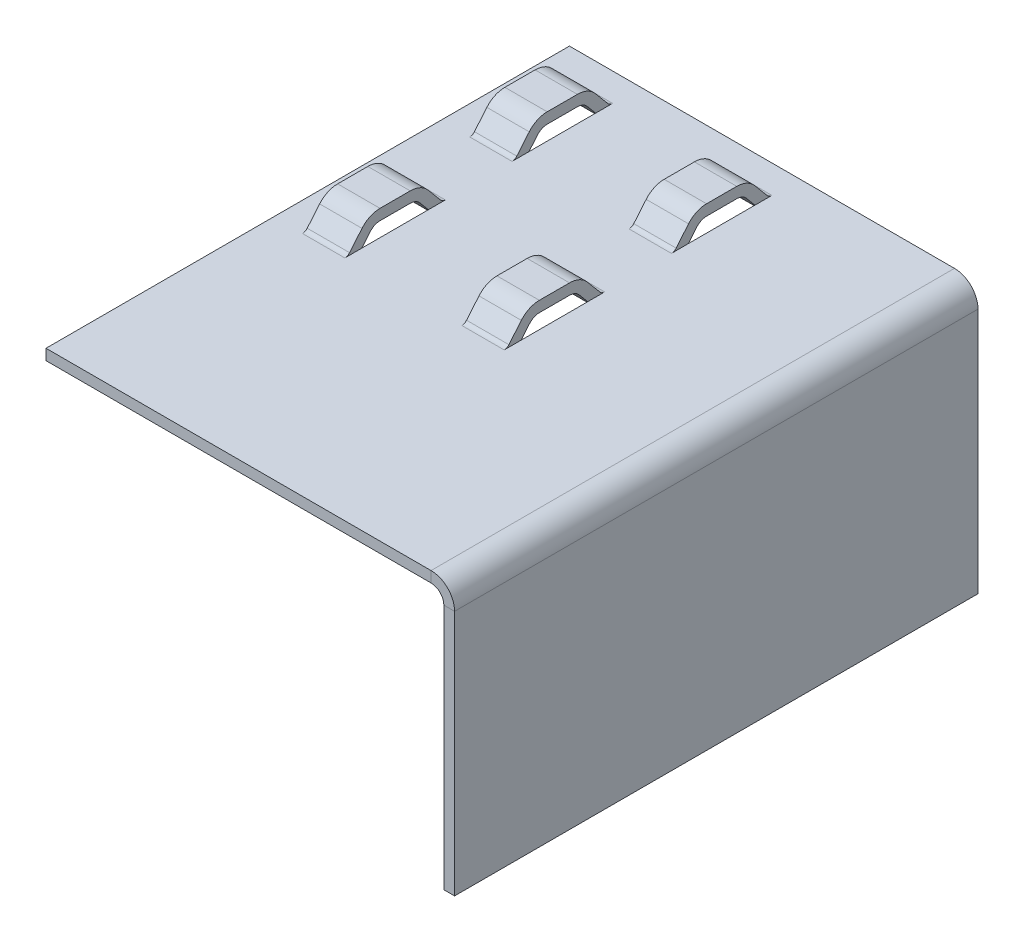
ISO-10303-21;
HEADER;
FILE_DESCRIPTION(('STEP AP214'),'2;1');
FILE_NAME('part.step','',(''),(''),'','','');
FILE_SCHEMA(('AUTOMOTIVE_DESIGN { 1 0 10303 214 1 1 1 1 }'));
ENDSEC;
DATA;
#1=APPLICATION_CONTEXT('core data for automotive mechanical design processes');
#2=APPLICATION_PROTOCOL_DEFINITION('international standard','automotive_design',2000,#1);
#3=PRODUCT_CONTEXT('',#1,'mechanical');
#4=PRODUCT('Part','Part','',(#3));
#5=PRODUCT_RELATED_PRODUCT_CATEGORY('part','',(#4));
#6=PRODUCT_DEFINITION_FORMATION('','',#4);
#7=PRODUCT_DEFINITION_CONTEXT('part definition',#1,'design');
#8=PRODUCT_DEFINITION('design','',#6,#7);
#9=PRODUCT_DEFINITION_SHAPE('','',#8);
#10=(LENGTH_UNIT() NAMED_UNIT(*) SI_UNIT(.MILLI.,.METRE.));
#11=(NAMED_UNIT(*) PLANE_ANGLE_UNIT() SI_UNIT($,.RADIAN.));
#12=(NAMED_UNIT(*) SI_UNIT($,.STERADIAN.) SOLID_ANGLE_UNIT());
#13=UNCERTAINTY_MEASURE_WITH_UNIT(LENGTH_MEASURE(1.E-05),#10,'distance_accuracy_value','');
#14=(GEOMETRIC_REPRESENTATION_CONTEXT(3) GLOBAL_UNCERTAINTY_ASSIGNED_CONTEXT((#13)) GLOBAL_UNIT_ASSIGNED_CONTEXT((#10,
#11,#12)) REPRESENTATION_CONTEXT('',''));
#15=CARTESIAN_POINT('',(0.,0.,0.));
#16=DIRECTION('',(0.,0.,1.));
#17=DIRECTION('',(1.,0.,0.));
#18=AXIS2_PLACEMENT_3D('',#15,#16,#17);
#19=CARTESIAN_POINT('',(0.,0.,0.));
#20=DIRECTION('',(0.,1.,0.));
#21=DIRECTION('',(0.,0.,1.));
#22=AXIS2_PLACEMENT_3D('',#19,#20,#21);
#23=PLANE('',#22);
#24=DIRECTION('',(1.,0.,0.));
#25=VECTOR('',#24,1.);
#26=CARTESIAN_POINT('',(-49.4316278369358,0.,56.669783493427));
#27=LINE('',#26,#25);
#28=CARTESIAN_POINT('',(-49.4316278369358,0.,56.669783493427));
#29=VERTEX_POINT('',#28);
#30=CARTESIAN_POINT('',(41.4724281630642,0.,56.669783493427));
#31=VERTEX_POINT('',#30);
#32=EDGE_CURVE('E1139',#29,#31,#27,.T.);
#33=ORIENTED_EDGE('',*,*,#32,.T.);
#34=DIRECTION('',(0.,0.,1.));
#35=VECTOR('',#34,1.);
#36=CARTESIAN_POINT('',(41.4724281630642,0.,56.669783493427));
#37=LINE('',#36,#35);
#38=CARTESIAN_POINT('',(41.4724281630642,0.,-66.9091836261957));
#39=VERTEX_POINT('',#38);
#40=EDGE_CURVE('E1104',#31,#39,#37,.F.);
#41=ORIENTED_EDGE('',*,*,#40,.T.);
#42=DIRECTION('',(-1.,0.,0.));
#43=VECTOR('',#42,1.);
#44=CARTESIAN_POINT('',(-49.4316278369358,0.,-66.9091836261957));
#45=LINE('',#44,#43);
#46=CARTESIAN_POINT('',(-49.4316278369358,0.,-66.9091836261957));
#47=VERTEX_POINT('',#46);
#48=EDGE_CURVE('E1131',#39,#47,#45,.T.);
#49=ORIENTED_EDGE('',*,*,#48,.T.);
#50=DIRECTION('',(0.,0.,1.));
#51=VECTOR('',#50,1.);
#52=CARTESIAN_POINT('',(-49.4316278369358,0.,-66.9091836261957));
#53=LINE('',#52,#51);
#54=EDGE_CURVE('E1124',#47,#29,#53,.T.);
#55=ORIENTED_EDGE('',*,*,#54,.T.);
#56=EDGE_LOOP('',(#33,#41,#49,#55));
#57=FACE_BOUND('',#56,.T.);
#58=DIRECTION('',(-1.,0.,0.));
#59=VECTOR('',#58,1.);
#60=CARTESIAN_POINT('',(-62.6175874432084,0.,-60.2792139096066));
#61=LINE('',#60,#59);
#62=CARTESIAN_POINT('',(-42.6175874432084,0.,-60.2792139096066));
#63=VERTEX_POINT('',#62);
#64=CARTESIAN_POINT('',(-32.6175874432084,0.,-60.2792139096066));
#65=VERTEX_POINT('',#64);
#66=EDGE_CURVE('E883',#63,#65,#61,.F.);
#67=ORIENTED_EDGE('',*,*,#66,.T.);
#68=DIRECTION('',(0.,0.,1.));
#69=VECTOR('',#68,1.);
#70=CARTESIAN_POINT('',(-32.6175874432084,0.,0.));
#71=LINE('',#70,#69);
#72=CARTESIAN_POINT('',(-32.6175874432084,0.,-56.2826702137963));
#73=VERTEX_POINT('',#72);
#74=EDGE_CURVE('E921',#65,#73,#71,.T.);
#75=ORIENTED_EDGE('',*,*,#74,.T.);
#76=DIRECTION('',(0.,0.,-1.));
#77=VECTOR('',#76,1.);
#78=CARTESIAN_POINT('',(-32.6175874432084,0.,0.));
#79=LINE('',#78,#77);
#80=CARTESIAN_POINT('',(-32.6175874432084,0.,-40.5452963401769));
#81=VERTEX_POINT('',#80);
#82=EDGE_CURVE('E42',#81,#73,#79,.T.);
#83=ORIENTED_EDGE('',*,*,#82,.F.);
#84=CARTESIAN_POINT('',(-32.6175874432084,0.,-36.5487526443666));
#85=VERTEX_POINT('',#84);
#86=EDGE_CURVE('E919',#81,#85,#71,.T.);
#87=ORIENTED_EDGE('',*,*,#86,.T.);
#88=DIRECTION('',(1.,0.,0.));
#89=VECTOR('',#88,1.);
#90=CARTESIAN_POINT('',(-42.6175874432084,0.,-36.5487526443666));
#91=LINE('',#90,#89);
#92=CARTESIAN_POINT('',(-42.6175874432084,0.,-36.5487526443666));
#93=VERTEX_POINT('',#92);
#94=EDGE_CURVE('E882',#85,#93,#91,.F.);
#95=ORIENTED_EDGE('',*,*,#94,.T.);
#96=DIRECTION('',(0.,0.,1.));
#97=VECTOR('',#96,1.);
#98=CARTESIAN_POINT('',(-42.6175874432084,0.,0.));
#99=LINE('',#98,#97);
#100=CARTESIAN_POINT('',(-42.6175874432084,0.,-40.5452963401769));
#101=VERTEX_POINT('',#100);
#102=EDGE_CURVE('E918',#93,#101,#99,.F.);
#103=ORIENTED_EDGE('',*,*,#102,.T.);
#104=DIRECTION('',(0.,0.,-1.));
#105=VECTOR('',#104,1.);
#106=CARTESIAN_POINT('',(-42.6175874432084,0.,0.));
#107=LINE('',#106,#105);
#108=CARTESIAN_POINT('',(-42.6175874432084,0.,-56.2826702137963));
#109=VERTEX_POINT('',#108);
#110=EDGE_CURVE('E11',#101,#109,#107,.T.);
#111=ORIENTED_EDGE('',*,*,#110,.T.);
#112=EDGE_CURVE('E859',#109,#63,#99,.F.);
#113=ORIENTED_EDGE('',*,*,#112,.T.);
#114=EDGE_LOOP('',(#67,#75,#83,#87,#95,#103,#111,#113));
#115=FACE_BOUND('',#114,.T.);
#116=DIRECTION('',(-1.,0.,0.));
#117=VECTOR('',#116,1.);
#118=CARTESIAN_POINT('',(-62.6175874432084,0.,-20.7995118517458));
#119=LINE('',#118,#117);
#120=CARTESIAN_POINT('',(-42.6175874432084,0.,-20.7995118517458));
#121=VERTEX_POINT('',#120);
#122=CARTESIAN_POINT('',(-32.6175874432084,0.,-20.7995118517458));
#123=VERTEX_POINT('',#122);
#124=EDGE_CURVE('E783',#121,#123,#119,.F.);
#125=ORIENTED_EDGE('',*,*,#124,.T.);
#126=DIRECTION('',(0.,0.,1.));
#127=VECTOR('',#126,1.);
#128=CARTESIAN_POINT('',(-32.6175874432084,0.,0.));
#129=LINE('',#128,#127);
#130=CARTESIAN_POINT('',(-32.6175874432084,0.,-16.8029681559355));
#131=VERTEX_POINT('',#130);
#132=EDGE_CURVE('E821',#123,#131,#129,.T.);
#133=ORIENTED_EDGE('',*,*,#132,.T.);
#134=DIRECTION('',(0.,0.,-1.));
#135=VECTOR('',#134,1.);
#136=CARTESIAN_POINT('',(-32.6175874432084,0.,0.));
#137=LINE('',#136,#135);
#138=CARTESIAN_POINT('',(-32.6175874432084,0.,-1.06559428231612));
#139=VERTEX_POINT('',#138);
#140=EDGE_CURVE('E1032',#139,#131,#137,.T.);
#141=ORIENTED_EDGE('',*,*,#140,.F.);
#142=CARTESIAN_POINT('',(-32.6175874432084,0.,2.93094941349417));
#143=VERTEX_POINT('',#142);
#144=EDGE_CURVE('E819',#139,#143,#129,.T.);
#145=ORIENTED_EDGE('',*,*,#144,.T.);
#146=DIRECTION('',(1.,0.,0.));
#147=VECTOR('',#146,1.);
#148=CARTESIAN_POINT('',(-42.6175874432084,0.,2.93094941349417));
#149=LINE('',#148,#147);
#150=CARTESIAN_POINT('',(-42.6175874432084,0.,2.93094941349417));
#151=VERTEX_POINT('',#150);
#152=EDGE_CURVE('E782',#143,#151,#149,.F.);
#153=ORIENTED_EDGE('',*,*,#152,.T.);
#154=DIRECTION('',(0.,0.,1.));
#155=VECTOR('',#154,1.);
#156=CARTESIAN_POINT('',(-42.6175874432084,0.,0.));
#157=LINE('',#156,#155);
#158=CARTESIAN_POINT('',(-42.6175874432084,0.,-1.06559428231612));
#159=VERTEX_POINT('',#158);
#160=EDGE_CURVE('E818',#151,#159,#157,.F.);
#161=ORIENTED_EDGE('',*,*,#160,.T.);
#162=DIRECTION('',(0.,0.,-1.));
#163=VECTOR('',#162,1.);
#164=CARTESIAN_POINT('',(-42.6175874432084,0.,0.));
#165=LINE('',#164,#163);
#166=CARTESIAN_POINT('',(-42.6175874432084,0.,-16.8029681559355));
#167=VERTEX_POINT('',#166);
#168=EDGE_CURVE('E1035',#159,#167,#165,.T.);
#169=ORIENTED_EDGE('',*,*,#168,.T.);
#170=EDGE_CURVE('E759',#167,#121,#157,.F.);
#171=ORIENTED_EDGE('',*,*,#170,.T.);
#172=EDGE_LOOP('',(#125,#133,#141,#145,#153,#161,#169,#171));
#173=FACE_BOUND('',#172,.T.);
#174=DIRECTION('',(-1.,0.,0.));
#175=VECTOR('',#174,1.);
#176=CARTESIAN_POINT('',(-25.0000000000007,0.,-20.7995118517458));
#177=LINE('',#176,#175);
#178=CARTESIAN_POINT('',(-5.00000000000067,0.,-20.7995118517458));
#179=VERTEX_POINT('',#178);
#180=CARTESIAN_POINT('',(4.99999999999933,0.,-20.7995118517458));
#181=VERTEX_POINT('',#180);
#182=EDGE_CURVE('E683',#179,#181,#177,.F.);
#183=ORIENTED_EDGE('',*,*,#182,.T.);
#184=DIRECTION('',(0.,0.,1.));
#185=VECTOR('',#184,1.);
#186=CARTESIAN_POINT('',(4.99999999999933,0.,0.));
#187=LINE('',#186,#185);
#188=CARTESIAN_POINT('',(4.99999999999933,0.,-16.8029681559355));
#189=VERTEX_POINT('',#188);
#190=EDGE_CURVE('E721',#181,#189,#187,.T.);
#191=ORIENTED_EDGE('',*,*,#190,.T.);
#192=DIRECTION('',(0.,0.,-1.));
#193=VECTOR('',#192,1.);
#194=CARTESIAN_POINT('',(4.99999999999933,0.,0.));
#195=LINE('',#194,#193);
#196=CARTESIAN_POINT('',(4.99999999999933,0.,-1.06559428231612));
#197=VERTEX_POINT('',#196);
#198=EDGE_CURVE('E993',#197,#189,#195,.T.);
#199=ORIENTED_EDGE('',*,*,#198,.F.);
#200=CARTESIAN_POINT('',(4.99999999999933,0.,2.93094941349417));
#201=VERTEX_POINT('',#200);
#202=EDGE_CURVE('E719',#197,#201,#187,.T.);
#203=ORIENTED_EDGE('',*,*,#202,.T.);
#204=DIRECTION('',(1.,0.,0.));
#205=VECTOR('',#204,1.);
#206=CARTESIAN_POINT('',(-5.00000000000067,0.,2.93094941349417));
#207=LINE('',#206,#205);
#208=CARTESIAN_POINT('',(-5.00000000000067,0.,2.93094941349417));
#209=VERTEX_POINT('',#208);
#210=EDGE_CURVE('E682',#201,#209,#207,.F.);
#211=ORIENTED_EDGE('',*,*,#210,.T.);
#212=DIRECTION('',(0.,0.,1.));
#213=VECTOR('',#212,1.);
#214=CARTESIAN_POINT('',(-5.00000000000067,0.,0.));
#215=LINE('',#214,#213);
#216=CARTESIAN_POINT('',(-5.00000000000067,0.,-1.06559428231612));
#217=VERTEX_POINT('',#216);
#218=EDGE_CURVE('E718',#209,#217,#215,.F.);
#219=ORIENTED_EDGE('',*,*,#218,.T.);
#220=DIRECTION('',(0.,0.,-1.));
#221=VECTOR('',#220,1.);
#222=CARTESIAN_POINT('',(-5.00000000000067,0.,0.));
#223=LINE('',#222,#221);
#224=CARTESIAN_POINT('',(-5.00000000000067,0.,-16.8029681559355));
#225=VERTEX_POINT('',#224);
#226=EDGE_CURVE('E996',#217,#225,#223,.T.);
#227=ORIENTED_EDGE('',*,*,#226,.T.);
#228=EDGE_CURVE('E659',#225,#179,#215,.F.);
#229=ORIENTED_EDGE('',*,*,#228,.T.);
#230=EDGE_LOOP('',(#183,#191,#199,#203,#211,#219,#227,#229));
#231=FACE_BOUND('',#230,.T.);
#232=DIRECTION('',(-1.,0.,0.));
#233=VECTOR('',#232,1.);
#234=CARTESIAN_POINT('',(-25.0000000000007,0.,-60.2792139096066));
#235=LINE('',#234,#233);
#236=CARTESIAN_POINT('',(-5.00000000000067,0.,-60.2792139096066));
#237=VERTEX_POINT('',#236);
#238=CARTESIAN_POINT('',(4.99999999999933,0.,-60.2792139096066));
#239=VERTEX_POINT('',#238);
#240=EDGE_CURVE('E56',#237,#239,#235,.F.);
#241=ORIENTED_EDGE('',*,*,#240,.T.);
#242=DIRECTION('',(0.,0.,1.));
#243=VECTOR('',#242,1.);
#244=CARTESIAN_POINT('',(4.99999999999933,0.,0.));
#245=LINE('',#244,#243);
#246=CARTESIAN_POINT('',(4.99999999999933,0.,-56.2826702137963));
#247=VERTEX_POINT('',#246);
#248=EDGE_CURVE('E621',#239,#247,#245,.T.);
#249=ORIENTED_EDGE('',*,*,#248,.T.);
#250=DIRECTION('',(0.,0.,-1.));
#251=VECTOR('',#250,1.);
#252=CARTESIAN_POINT('',(4.99999999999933,0.,0.));
#253=LINE('',#252,#251);
#254=CARTESIAN_POINT('',(4.99999999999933,0.,-40.5452963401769));
#255=VERTEX_POINT('',#254);
#256=EDGE_CURVE('E954',#255,#247,#253,.T.);
#257=ORIENTED_EDGE('',*,*,#256,.F.);
#258=CARTESIAN_POINT('',(4.99999999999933,0.,-36.5487526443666));
#259=VERTEX_POINT('',#258);
#260=EDGE_CURVE('E538',#255,#259,#245,.T.);
#261=ORIENTED_EDGE('',*,*,#260,.T.);
#262=DIRECTION('',(1.,0.,0.));
#263=VECTOR('',#262,1.);
#264=CARTESIAN_POINT('',(-5.00000000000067,0.,-36.5487526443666));
#265=LINE('',#264,#263);
#266=CARTESIAN_POINT('',(-5.00000000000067,0.,-36.5487526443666));
#267=VERTEX_POINT('',#266);
#268=EDGE_CURVE('E49',#259,#267,#265,.F.);
#269=ORIENTED_EDGE('',*,*,#268,.T.);
#270=DIRECTION('',(0.,0.,1.));
#271=VECTOR('',#270,1.);
#272=CARTESIAN_POINT('',(-5.00000000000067,0.,0.));
#273=LINE('',#272,#271);
#274=CARTESIAN_POINT('',(-5.00000000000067,0.,-40.5452963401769));
#275=VERTEX_POINT('',#274);
#276=EDGE_CURVE('E559',#267,#275,#273,.F.);
#277=ORIENTED_EDGE('',*,*,#276,.T.);
#278=DIRECTION('',(0.,0.,-1.));
#279=VECTOR('',#278,1.);
#280=CARTESIAN_POINT('',(-5.00000000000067,0.,0.));
#281=LINE('',#280,#279);
#282=CARTESIAN_POINT('',(-5.00000000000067,0.,-56.2826702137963));
#283=VERTEX_POINT('',#282);
#284=EDGE_CURVE('E957',#275,#283,#281,.T.);
#285=ORIENTED_EDGE('',*,*,#284,.T.);
#286=EDGE_CURVE('E556',#283,#237,#273,.F.);
#287=ORIENTED_EDGE('',*,*,#286,.T.);
#288=EDGE_LOOP('',(#241,#249,#257,#261,#269,#277,#285,#287));
#289=FACE_BOUND('',#288,.T.);
#290=ADVANCED_FACE('F34',(#57,#115,#173,#231,#289),#23,.T.);
#291=CARTESIAN_POINT('',(-49.4316278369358,-2.54,56.669783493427));
#292=DIRECTION('',(0.,0.,1.));
#293=DIRECTION('',(1.,0.,0.));
#294=AXIS2_PLACEMENT_3D('',#291,#292,#293);
#295=PLANE('',#294);
#296=DIRECTION('',(1.,0.,0.));
#297=VECTOR('',#296,1.);
#298=CARTESIAN_POINT('',(-49.4316278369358,-2.54,56.669783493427));
#299=LINE('',#298,#297);
#300=CARTESIAN_POINT('',(-49.4316278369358,-2.54,56.669783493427));
#301=VERTEX_POINT('',#300);
#302=CARTESIAN_POINT('',(41.4724281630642,-2.54,56.669783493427));
#303=VERTEX_POINT('',#302);
#304=EDGE_CURVE('E1130',#301,#303,#299,.T.);
#305=ORIENTED_EDGE('',*,*,#304,.T.);
#306=DIRECTION('',(0.,1.,0.));
#307=VECTOR('',#306,1.);
#308=CARTESIAN_POINT('',(41.4724281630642,-2.54,56.669783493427));
#309=LINE('',#308,#307);
#310=EDGE_CURVE('E1111',#303,#31,#309,.T.);
#311=ORIENTED_EDGE('',*,*,#310,.T.);
#312=ORIENTED_EDGE('',*,*,#32,.F.);
#313=DIRECTION('',(0.,1.,0.));
#314=VECTOR('',#313,1.);
#315=CARTESIAN_POINT('',(-49.4316278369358,-2.54,56.669783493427));
#316=LINE('',#315,#314);
#317=EDGE_CURVE('E1136',#301,#29,#316,.T.);
#318=ORIENTED_EDGE('',*,*,#317,.F.);
#319=EDGE_LOOP('',(#305,#311,#312,#318));
#320=FACE_BOUND('',#319,.T.);
#321=ADVANCED_FACE('F1232',(#320),#295,.T.);
#322=CARTESIAN_POINT('',(0.,-2.54,0.));
#323=DIRECTION('',(0.,1.,0.));
#324=DIRECTION('',(0.,0.,1.));
#325=AXIS2_PLACEMENT_3D('',#322,#323,#324);
#326=PLANE('',#325);
#327=DIRECTION('',(0.,0.,-1.));
#328=VECTOR('',#327,1.);
#329=CARTESIAN_POINT('',(4.99999999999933,-2.54,-38.4139832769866));
#330=LINE('',#329,#328);
#331=CARTESIAN_POINT('',(4.99999999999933,-2.54,-36.5487526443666));
#332=VERTEX_POINT('',#331);
#333=CARTESIAN_POINT('',(4.99999999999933,-2.54,-60.2792139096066));
#334=VERTEX_POINT('',#333);
#335=EDGE_CURVE('E922',#332,#334,#330,.T.);
#336=ORIENTED_EDGE('',*,*,#335,.T.);
#337=DIRECTION('',(1.,0.,0.));
#338=VECTOR('',#337,1.);
#339=CARTESIAN_POINT('',(4.99999999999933,-2.54,-60.2792139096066));
#340=LINE('',#339,#338);
#341=CARTESIAN_POINT('',(-5.00000000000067,-2.54,-60.2792139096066));
#342=VERTEX_POINT('',#341);
#343=EDGE_CURVE('E938',#342,#334,#340,.T.);
#344=ORIENTED_EDGE('',*,*,#343,.F.);
#345=DIRECTION('',(0.,0.,-1.));
#346=VECTOR('',#345,1.);
#347=CARTESIAN_POINT('',(-5.00000000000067,-2.54,-38.4139832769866));
#348=LINE('',#347,#346);
#349=CARTESIAN_POINT('',(-5.00000000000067,-2.54,-36.5487526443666));
#350=VERTEX_POINT('',#349);
#351=EDGE_CURVE('E930',#350,#342,#348,.T.);
#352=ORIENTED_EDGE('',*,*,#351,.F.);
#353=DIRECTION('',(1.,0.,0.));
#354=VECTOR('',#353,1.);
#355=CARTESIAN_POINT('',(-25.0000000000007,-2.54,-36.5487526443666));
#356=LINE('',#355,#354);
#357=EDGE_CURVE('E936',#332,#350,#356,.F.);
#358=ORIENTED_EDGE('',*,*,#357,.F.);
#359=EDGE_LOOP('',(#336,#344,#352,#358));
#360=FACE_BOUND('',#359,.T.);
#361=DIRECTION('',(0.,0.,-1.));
#362=VECTOR('',#361,1.);
#363=CARTESIAN_POINT('',(4.99999999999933,-2.54,1.06571878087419));
#364=LINE('',#363,#362);
#365=CARTESIAN_POINT('',(4.99999999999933,-2.54,2.93094941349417));
#366=VERTEX_POINT('',#365);
#367=CARTESIAN_POINT('',(4.99999999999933,-2.54,-20.7995118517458));
#368=VERTEX_POINT('',#367);
#369=EDGE_CURVE('E960',#366,#368,#364,.T.);
#370=ORIENTED_EDGE('',*,*,#369,.T.);
#371=DIRECTION('',(1.,0.,0.));
#372=VECTOR('',#371,1.);
#373=CARTESIAN_POINT('',(4.99999999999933,-2.54,-20.7995118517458));
#374=LINE('',#373,#372);
#375=CARTESIAN_POINT('',(-5.00000000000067,-2.54,-20.7995118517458));
#376=VERTEX_POINT('',#375);
#377=EDGE_CURVE('E977',#376,#368,#374,.T.);
#378=ORIENTED_EDGE('',*,*,#377,.F.);
#379=DIRECTION('',(0.,0.,-1.));
#380=VECTOR('',#379,1.);
#381=CARTESIAN_POINT('',(-5.00000000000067,-2.54,1.06571878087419));
#382=LINE('',#381,#380);
#383=CARTESIAN_POINT('',(-5.00000000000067,-2.54,2.93094941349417));
#384=VERTEX_POINT('',#383);
#385=EDGE_CURVE('E968',#384,#376,#382,.T.);
#386=ORIENTED_EDGE('',*,*,#385,.F.);
#387=DIRECTION('',(1.,0.,0.));
#388=VECTOR('',#387,1.);
#389=CARTESIAN_POINT('',(-25.0000000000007,-2.54,2.93094941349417));
#390=LINE('',#389,#388);
#391=EDGE_CURVE('E975',#366,#384,#390,.F.);
#392=ORIENTED_EDGE('',*,*,#391,.F.);
#393=EDGE_LOOP('',(#370,#378,#386,#392));
#394=FACE_BOUND('',#393,.T.);
#395=DIRECTION('',(0.,0.,-1.));
#396=VECTOR('',#395,1.);
#397=CARTESIAN_POINT('',(-32.6175874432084,-2.54,1.06571878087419));
#398=LINE('',#397,#396);
#399=CARTESIAN_POINT('',(-32.6175874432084,-2.54,2.93094941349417));
#400=VERTEX_POINT('',#399);
#401=CARTESIAN_POINT('',(-32.6175874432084,-2.54,-20.7995118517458));
#402=VERTEX_POINT('',#401);
#403=EDGE_CURVE('E999',#400,#402,#398,.T.);
#404=ORIENTED_EDGE('',*,*,#403,.T.);
#405=DIRECTION('',(1.,0.,0.));
#406=VECTOR('',#405,1.);
#407=CARTESIAN_POINT('',(-32.6175874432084,-2.54,-20.7995118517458));
#408=LINE('',#407,#406);
#409=CARTESIAN_POINT('',(-42.6175874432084,-2.54,-20.7995118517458));
#410=VERTEX_POINT('',#409);
#411=EDGE_CURVE('E1016',#410,#402,#408,.T.);
#412=ORIENTED_EDGE('',*,*,#411,.F.);
#413=DIRECTION('',(0.,0.,-1.));
#414=VECTOR('',#413,1.);
#415=CARTESIAN_POINT('',(-42.6175874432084,-2.54,1.06571878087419));
#416=LINE('',#415,#414);
#417=CARTESIAN_POINT('',(-42.6175874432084,-2.54,2.93094941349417));
#418=VERTEX_POINT('',#417);
#419=EDGE_CURVE('E1007',#418,#410,#416,.T.);
#420=ORIENTED_EDGE('',*,*,#419,.F.);
#421=DIRECTION('',(1.,0.,0.));
#422=VECTOR('',#421,1.);
#423=CARTESIAN_POINT('',(-62.6175874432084,-2.54,2.93094941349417));
#424=LINE('',#423,#422);
#425=EDGE_CURVE('E1014',#400,#418,#424,.F.);
#426=ORIENTED_EDGE('',*,*,#425,.F.);
#427=EDGE_LOOP('',(#404,#412,#420,#426));
#428=FACE_BOUND('',#427,.T.);
#429=DIRECTION('',(0.,0.,-1.));
#430=VECTOR('',#429,1.);
#431=CARTESIAN_POINT('',(-32.6175874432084,-2.54,-38.4139832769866));
#432=LINE('',#431,#430);
#433=CARTESIAN_POINT('',(-32.6175874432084,-2.54,-36.5487526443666));
#434=VERTEX_POINT('',#433);
#435=CARTESIAN_POINT('',(-32.6175874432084,-2.54,-60.2792139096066));
#436=VERTEX_POINT('',#435);
#437=EDGE_CURVE('E1038',#434,#436,#432,.T.);
#438=ORIENTED_EDGE('',*,*,#437,.T.);
#439=DIRECTION('',(1.,0.,0.));
#440=VECTOR('',#439,1.);
#441=CARTESIAN_POINT('',(-32.6175874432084,-2.54,-60.2792139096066));
#442=LINE('',#441,#440);
#443=CARTESIAN_POINT('',(-42.6175874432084,-2.54,-60.2792139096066));
#444=VERTEX_POINT('',#443);
#445=EDGE_CURVE('E1055',#444,#436,#442,.T.);
#446=ORIENTED_EDGE('',*,*,#445,.F.);
#447=DIRECTION('',(0.,0.,-1.));
#448=VECTOR('',#447,1.);
#449=CARTESIAN_POINT('',(-42.6175874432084,-2.54,-38.4139832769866));
#450=LINE('',#449,#448);
#451=CARTESIAN_POINT('',(-42.6175874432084,-2.54,-36.5487526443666));
#452=VERTEX_POINT('',#451);
#453=EDGE_CURVE('E1046',#452,#444,#450,.T.);
#454=ORIENTED_EDGE('',*,*,#453,.F.);
#455=DIRECTION('',(1.,0.,0.));
#456=VECTOR('',#455,1.);
#457=CARTESIAN_POINT('',(-62.6175874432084,-2.54,-36.5487526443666));
#458=LINE('',#457,#456);
#459=EDGE_CURVE('E1053',#434,#452,#458,.F.);
#460=ORIENTED_EDGE('',*,*,#459,.F.);
#461=EDGE_LOOP('',(#438,#446,#454,#460));
#462=FACE_BOUND('',#461,.T.);
#463=DIRECTION('',(0.,0.,1.));
#464=VECTOR('',#463,1.);
#465=CARTESIAN_POINT('',(41.4724281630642,-2.54,56.669783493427));
#466=LINE('',#465,#464);
#467=CARTESIAN_POINT('',(41.4724281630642,-2.54,-66.9091836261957));
#468=VERTEX_POINT('',#467);
#469=EDGE_CURVE('E1117',#303,#468,#466,.F.);
#470=ORIENTED_EDGE('',*,*,#469,.F.);
#471=ORIENTED_EDGE('',*,*,#304,.F.);
#472=DIRECTION('',(0.,0.,1.));
#473=VECTOR('',#472,1.);
#474=CARTESIAN_POINT('',(-49.4316278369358,-2.54,-66.9091836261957));
#475=LINE('',#474,#473);
#476=CARTESIAN_POINT('',(-49.4316278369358,-2.54,-66.9091836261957));
#477=VERTEX_POINT('',#476);
#478=EDGE_CURVE('E1127',#477,#301,#475,.T.);
#479=ORIENTED_EDGE('',*,*,#478,.F.);
#480=DIRECTION('',(-1.,0.,0.));
#481=VECTOR('',#480,1.);
#482=CARTESIAN_POINT('',(-49.4316278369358,-2.54,-66.9091836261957));
#483=LINE('',#482,#481);
#484=EDGE_CURVE('E1134',#468,#477,#483,.T.);
#485=ORIENTED_EDGE('',*,*,#484,.F.);
#486=EDGE_LOOP('',(#470,#471,#479,#485));
#487=FACE_BOUND('',#486,.T.);
#488=ADVANCED_FACE('F1238',(#360,#394,#428,#462,#487),#326,.F.);
#489=CARTESIAN_POINT('',(-49.4316278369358,-2.54,-66.9091836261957));
#490=DIRECTION('',(-1.,0.,0.));
#491=DIRECTION('',(0.,0.,1.));
#492=AXIS2_PLACEMENT_3D('',#489,#490,#491);
#493=PLANE('',#492);
#494=ORIENTED_EDGE('',*,*,#54,.F.);
#495=DIRECTION('',(0.,1.,0.));
#496=VECTOR('',#495,1.);
#497=CARTESIAN_POINT('',(-49.4316278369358,-2.54,-66.9091836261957));
#498=LINE('',#497,#496);
#499=EDGE_CURVE('E1143',#477,#47,#498,.T.);
#500=ORIENTED_EDGE('',*,*,#499,.F.);
#501=ORIENTED_EDGE('',*,*,#478,.T.);
#502=ORIENTED_EDGE('',*,*,#317,.T.);
#503=EDGE_LOOP('',(#494,#500,#501,#502));
#504=FACE_BOUND('',#503,.T.);
#505=ADVANCED_FACE('F36',(#504),#493,.T.);
#506=CARTESIAN_POINT('',(-49.4316278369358,-2.54,-66.9091836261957));
#507=DIRECTION('',(0.,0.,-1.));
#508=DIRECTION('',(-1.,0.,0.));
#509=AXIS2_PLACEMENT_3D('',#506,#507,#508);
#510=PLANE('',#509);
#511=DIRECTION('',(0.,1.,0.));
#512=VECTOR('',#511,1.);
#513=CARTESIAN_POINT('',(41.4724281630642,-2.54,-66.9091836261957));
#514=LINE('',#513,#512);
#515=EDGE_CURVE('E1121',#468,#39,#514,.T.);
#516=ORIENTED_EDGE('',*,*,#515,.F.);
#517=ORIENTED_EDGE('',*,*,#484,.T.);
#518=ORIENTED_EDGE('',*,*,#499,.T.);
#519=ORIENTED_EDGE('',*,*,#48,.F.);
#520=EDGE_LOOP('',(#516,#517,#518,#519));
#521=FACE_BOUND('',#520,.T.);
#522=ADVANCED_FACE('F1243',(#521),#510,.T.);
#523=CARTESIAN_POINT('',(41.4724281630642,-5.556,-66.9091836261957));
#524=DIRECTION('',(0.,0.,-1.));
#525=DIRECTION('',(-1.,0.,0.));
#526=AXIS2_PLACEMENT_3D('',#523,#524,#525);
#527=PLANE('',#526);
#528=DIRECTION('',(1.,0.,0.));
#529=VECTOR('',#528,1.);
#530=CARTESIAN_POINT('',(44.4884281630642,-5.55599999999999,-66.9091836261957));
#531=LINE('',#530,#529);
#532=CARTESIAN_POINT('',(44.4884281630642,-5.55599999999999,-66.9091836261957));
#533=VERTEX_POINT('',#532);
#534=CARTESIAN_POINT('',(47.0284281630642,-5.55599999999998,-66.9091836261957));
#535=VERTEX_POINT('',#534);
#536=EDGE_CURVE('E1071',#533,#535,#531,.T.);
#537=ORIENTED_EDGE('',*,*,#536,.F.);
#538=CARTESIAN_POINT('',(41.4724281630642,-5.556,-66.9091836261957));
#539=DIRECTION('',(0.,0.,1.));
#540=DIRECTION('',(1.,0.,0.));
#541=AXIS2_PLACEMENT_3D('',#538,#539,#540);
#542=CIRCLE('',#541,3.016);
#543=EDGE_CURVE('E1114',#468,#533,#542,.F.);
#544=ORIENTED_EDGE('',*,*,#543,.F.);
#545=ORIENTED_EDGE('',*,*,#515,.T.);
#546=CARTESIAN_POINT('',(41.4724281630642,-5.556,-66.9091836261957));
#547=DIRECTION('',(0.,0.,1.));
#548=DIRECTION('',(1.,0.,0.));
#549=AXIS2_PLACEMENT_3D('',#546,#547,#548);
#550=CIRCLE('',#549,5.55600000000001);
#551=EDGE_CURVE('E1107',#39,#535,#550,.F.);
#552=ORIENTED_EDGE('',*,*,#551,.T.);
#553=EDGE_LOOP('',(#537,#544,#545,#552));
#554=FACE_BOUND('',#553,.T.);
#555=ADVANCED_FACE('F1245',(#554),#527,.T.);
#556=CARTESIAN_POINT('',(41.4724281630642,-5.556,56.669783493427));
#557=DIRECTION('',(0.,0.,-1.));
#558=DIRECTION('',(-1.,0.,0.));
#559=AXIS2_PLACEMENT_3D('',#556,#557,#558);
#560=PLANE('',#559);
#561=CARTESIAN_POINT('',(41.4724281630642,-5.556,56.669783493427));
#562=DIRECTION('',(0.,0.,1.));
#563=DIRECTION('',(1.,0.,0.));
#564=AXIS2_PLACEMENT_3D('',#561,#562,#563);
#565=CIRCLE('',#564,3.016);
#566=CARTESIAN_POINT('',(44.4884281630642,-5.55599999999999,56.669783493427));
#567=VERTEX_POINT('',#566);
#568=EDGE_CURVE('E1101',#567,#303,#565,.T.);
#569=ORIENTED_EDGE('',*,*,#568,.F.);
#570=DIRECTION('',(1.,0.,0.));
#571=VECTOR('',#570,1.);
#572=CARTESIAN_POINT('',(44.4884281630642,-5.55599999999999,56.669783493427));
#573=LINE('',#572,#571);
#574=CARTESIAN_POINT('',(47.0284281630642,-5.55599999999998,56.669783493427));
#575=VERTEX_POINT('',#574);
#576=EDGE_CURVE('E1074',#567,#575,#573,.T.);
#577=ORIENTED_EDGE('',*,*,#576,.T.);
#578=CARTESIAN_POINT('',(41.4724281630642,-5.556,56.669783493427));
#579=DIRECTION('',(0.,0.,1.));
#580=DIRECTION('',(1.,0.,0.));
#581=AXIS2_PLACEMENT_3D('',#578,#579,#580);
#582=CIRCLE('',#581,5.55600000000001);
#583=EDGE_CURVE('E1108',#575,#31,#582,.T.);
#584=ORIENTED_EDGE('',*,*,#583,.T.);
#585=ORIENTED_EDGE('',*,*,#310,.F.);
#586=EDGE_LOOP('',(#569,#577,#584,#585));
#587=FACE_BOUND('',#586,.T.);
#588=ADVANCED_FACE('F1251',(#587),#560,.F.);
#589=CARTESIAN_POINT('',(41.4724281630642,-5.556,56.669783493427));
#590=DIRECTION('',(0.,0.,1.));
#591=DIRECTION('',(1.,0.,0.));
#592=AXIS2_PLACEMENT_3D('',#589,#590,#591);
#593=CYLINDRICAL_SURFACE('',#592,5.55600000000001);
#594=ORIENTED_EDGE('',*,*,#40,.F.);
#595=ORIENTED_EDGE('',*,*,#583,.F.);
#596=DIRECTION('',(0.,0.,1.));
#597=VECTOR('',#596,1.);
#598=CARTESIAN_POINT('',(47.0284281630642,-5.55599999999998,0.));
#599=LINE('',#598,#597);
#600=EDGE_CURVE('E1077',#535,#575,#599,.T.);
#601=ORIENTED_EDGE('',*,*,#600,.F.);
#602=ORIENTED_EDGE('',*,*,#551,.F.);
#603=EDGE_LOOP('',(#594,#595,#601,#602));
#604=FACE_BOUND('',#603,.T.);
#605=ADVANCED_FACE('F1267',(#604),#593,.T.);
#606=CARTESIAN_POINT('',(41.4724281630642,-5.556,56.669783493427));
#607=DIRECTION('',(0.,0.,1.));
#608=DIRECTION('',(1.,0.,0.));
#609=AXIS2_PLACEMENT_3D('',#606,#607,#608);
#610=CYLINDRICAL_SURFACE('',#609,3.016);
#611=ORIENTED_EDGE('',*,*,#469,.T.);
#612=ORIENTED_EDGE('',*,*,#543,.T.);
#613=DIRECTION('',(0.,0.,1.));
#614=VECTOR('',#613,1.);
#615=CARTESIAN_POINT('',(44.4884281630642,-5.55599999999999,-66.9091836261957));
#616=LINE('',#615,#614);
#617=EDGE_CURVE('E1072',#533,#567,#616,.T.);
#618=ORIENTED_EDGE('',*,*,#617,.T.);
#619=ORIENTED_EDGE('',*,*,#568,.T.);
#620=EDGE_LOOP('',(#611,#612,#618,#619));
#621=FACE_BOUND('',#620,.T.);
#622=ADVANCED_FACE('F1288',(#621),#610,.F.);
#623=CARTESIAN_POINT('',(47.0284281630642,-2.53999999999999,56.669783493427));
#624=DIRECTION('',(0.,0.,1.));
#625=DIRECTION('',(0.,-1.,0.));
#626=AXIS2_PLACEMENT_3D('',#623,#624,#625);
#627=PLANE('',#626);
#628=DIRECTION('',(0.,1.,0.));
#629=VECTOR('',#628,1.);
#630=CARTESIAN_POINT('',(47.0284281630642,-2.53999999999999,56.669783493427));
#631=LINE('',#630,#629);
#632=CARTESIAN_POINT('',(47.0284281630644,-63.754,56.669783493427));
#633=VERTEX_POINT('',#632);
#634=EDGE_CURVE('E1089',#633,#575,#631,.T.);
#635=ORIENTED_EDGE('',*,*,#634,.T.);
#636=ORIENTED_EDGE('',*,*,#576,.F.);
#637=DIRECTION('',(0.,1.,0.));
#638=VECTOR('',#637,1.);
#639=CARTESIAN_POINT('',(44.4884281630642,-2.54,56.669783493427));
#640=LINE('',#639,#638);
#641=CARTESIAN_POINT('',(44.4884281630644,-63.754,56.669783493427));
#642=VERTEX_POINT('',#641);
#643=EDGE_CURVE('E1086',#642,#567,#640,.T.);
#644=ORIENTED_EDGE('',*,*,#643,.F.);
#645=DIRECTION('',(-1.,0.,0.));
#646=VECTOR('',#645,1.);
#647=CARTESIAN_POINT('',(47.0284281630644,-63.754,56.669783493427));
#648=LINE('',#647,#646);
#649=EDGE_CURVE('E1099',#633,#642,#648,.T.);
#650=ORIENTED_EDGE('',*,*,#649,.F.);
#651=EDGE_LOOP('',(#635,#636,#644,#650));
#652=FACE_BOUND('',#651,.T.);
#653=ADVANCED_FACE('F1278',(#652),#627,.T.);
#654=CARTESIAN_POINT('',(47.0284281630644,-63.754,-66.9091836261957));
#655=DIRECTION('',(0.,0.,-1.));
#656=DIRECTION('',(-1.,0.,0.));
#657=AXIS2_PLACEMENT_3D('',#654,#655,#656);
#658=PLANE('',#657);
#659=DIRECTION('',(0.,-1.,0.));
#660=VECTOR('',#659,1.);
#661=CARTESIAN_POINT('',(44.4884281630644,-63.754,-66.9091836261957));
#662=LINE('',#661,#660);
#663=CARTESIAN_POINT('',(44.4884281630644,-63.754,-66.9091836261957));
#664=VERTEX_POINT('',#663);
#665=EDGE_CURVE('E1082',#533,#664,#662,.T.);
#666=ORIENTED_EDGE('',*,*,#665,.F.);
#667=ORIENTED_EDGE('',*,*,#536,.T.);
#668=DIRECTION('',(0.,-1.,0.));
#669=VECTOR('',#668,1.);
#670=CARTESIAN_POINT('',(47.0284281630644,-63.754,-66.9091836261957));
#671=LINE('',#670,#669);
#672=CARTESIAN_POINT('',(47.0284281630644,-63.754,-66.9091836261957));
#673=VERTEX_POINT('',#672);
#674=EDGE_CURVE('E1083',#535,#673,#671,.T.);
#675=ORIENTED_EDGE('',*,*,#674,.T.);
#676=DIRECTION('',(-1.,0.,0.));
#677=VECTOR('',#676,1.);
#678=CARTESIAN_POINT('',(47.0284281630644,-63.754,-66.9091836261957));
#679=LINE('',#678,#677);
#680=EDGE_CURVE('E1092',#673,#664,#679,.T.);
#681=ORIENTED_EDGE('',*,*,#680,.T.);
#682=EDGE_LOOP('',(#666,#667,#675,#681));
#683=FACE_BOUND('',#682,.T.);
#684=ADVANCED_FACE('F1285',(#683),#658,.T.);
#685=CARTESIAN_POINT('',(47.0284281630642,1.652004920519E-13,0.));
#686=DIRECTION('',(1.,0.,0.));
#687=DIRECTION('',(0.,1.,0.));
#688=AXIS2_PLACEMENT_3D('',#685,#686,#687);
#689=PLANE('',#688);
#690=ORIENTED_EDGE('',*,*,#674,.F.);
#691=ORIENTED_EDGE('',*,*,#600,.T.);
#692=ORIENTED_EDGE('',*,*,#634,.F.);
#693=DIRECTION('',(0.,0.,1.));
#694=VECTOR('',#693,1.);
#695=CARTESIAN_POINT('',(47.0284281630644,-63.754,56.669783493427));
#696=LINE('',#695,#694);
#697=EDGE_CURVE('E1085',#673,#633,#696,.T.);
#698=ORIENTED_EDGE('',*,*,#697,.F.);
#699=EDGE_LOOP('',(#690,#691,#692,#698));
#700=FACE_BOUND('',#699,.T.);
#701=ADVANCED_FACE('F1276',(#700),#689,.T.);
#702=CARTESIAN_POINT('',(44.4884281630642,1.56332129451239E-13,0.));
#703=DIRECTION('',(1.,0.,0.));
#704=DIRECTION('',(0.,1.,0.));
#705=AXIS2_PLACEMENT_3D('',#702,#703,#704);
#706=PLANE('',#705);
#707=ORIENTED_EDGE('',*,*,#617,.F.);
#708=ORIENTED_EDGE('',*,*,#665,.T.);
#709=DIRECTION('',(0.,0.,1.));
#710=VECTOR('',#709,1.);
#711=CARTESIAN_POINT('',(44.4884281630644,-63.754,56.669783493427));
#712=LINE('',#711,#710);
#713=EDGE_CURVE('E1094',#664,#642,#712,.T.);
#714=ORIENTED_EDGE('',*,*,#713,.T.);
#715=ORIENTED_EDGE('',*,*,#643,.T.);
#716=EDGE_LOOP('',(#707,#708,#714,#715));
#717=FACE_BOUND('',#716,.T.);
#718=ADVANCED_FACE('F1290',(#717),#706,.F.);
#719=CARTESIAN_POINT('',(47.0284281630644,-63.754,56.669783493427));
#720=DIRECTION('',(0.,-1.,0.));
#721=DIRECTION('',(1.,0.,0.));
#722=AXIS2_PLACEMENT_3D('',#719,#720,#721);
#723=PLANE('',#722);
#724=ORIENTED_EDGE('',*,*,#713,.F.);
#725=ORIENTED_EDGE('',*,*,#680,.F.);
#726=ORIENTED_EDGE('',*,*,#697,.T.);
#727=ORIENTED_EDGE('',*,*,#649,.T.);
#728=EDGE_LOOP('',(#724,#725,#726,#727));
#729=FACE_BOUND('',#728,.T.);
#730=ADVANCED_FACE('F1282',(#729),#723,.T.);
#731=CARTESIAN_POINT('',(-42.6175874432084,-2.54,-38.4139832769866));
#732=DIRECTION('',(0.,-0.642787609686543,-0.766044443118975));
#733=DIRECTION('',(0.,-0.766044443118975,0.642787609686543));
#734=AXIS2_PLACEMENT_3D('',#731,#732,#733);
#735=PLANE('',#734);
#736=DIRECTION('',(0.,0.766044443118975,-0.642787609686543));
#737=VECTOR('',#736,1.);
#738=CARTESIAN_POINT('',(-32.6175874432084,-2.54,-38.4139832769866));
#739=LINE('',#738,#737);
#740=CARTESIAN_POINT('',(-32.6175874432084,-1.11115043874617,-39.6129304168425));
#741=VERTEX_POINT('',#740);
#742=EDGE_CURVE('E1044',#741,#81,#739,.T.);
#743=ORIENTED_EDGE('',*,*,#742,.F.);
#744=DIRECTION('',(1.,0.,0.));
#745=VECTOR('',#744,1.);
#746=CARTESIAN_POINT('',(-42.6175874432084,-1.11115043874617,-39.6129304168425));
#747=LINE('',#746,#745);
#748=CARTESIAN_POINT('',(-42.6175874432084,-1.11115043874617,-39.6129304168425));
#749=VERTEX_POINT('',#748);
#750=EDGE_CURVE('E1059',#749,#741,#747,.T.);
#751=ORIENTED_EDGE('',*,*,#750,.F.);
#752=DIRECTION('',(0.,0.766044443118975,-0.642787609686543));
#753=VECTOR('',#752,1.);
#754=CARTESIAN_POINT('',(-42.6175874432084,-2.54,-38.4139832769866));
#755=LINE('',#754,#753);
#756=EDGE_CURVE('E1050',#749,#101,#755,.T.);
#757=ORIENTED_EDGE('',*,*,#756,.T.);
#758=DIRECTION('',(0.,0.766044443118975,-0.642787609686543));
#759=VECTOR('',#758,1.);
#760=CARTESIAN_POINT('',(-42.6175874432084,-2.54,-38.4139832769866));
#761=LINE('',#760,#759);
#762=CARTESIAN_POINT('',(-42.6175874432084,2.38836282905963,-42.5493707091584));
#763=VERTEX_POINT('',#762);
#764=EDGE_CURVE('E822',#101,#763,#761,.T.);
#765=ORIENTED_EDGE('',*,*,#764,.T.);
#766=DIRECTION('',(1.,0.,0.));
#767=VECTOR('',#766,1.);
#768=CARTESIAN_POINT('',(-42.6175874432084,2.38836282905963,-42.5493707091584));
#769=LINE('',#768,#767);
#770=CARTESIAN_POINT('',(-32.6175874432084,2.38836282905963,-42.5493707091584));
#771=VERTEX_POINT('',#770);
#772=EDGE_CURVE('E827',#771,#763,#769,.F.);
#773=ORIENTED_EDGE('',*,*,#772,.F.);
#774=DIRECTION('',(0.,0.766044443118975,-0.642787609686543));
#775=VECTOR('',#774,1.);
#776=CARTESIAN_POINT('',(-32.6175874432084,-2.54,-38.4139832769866));
#777=LINE('',#776,#775);
#778=EDGE_CURVE('E824',#81,#771,#777,.T.);
#779=ORIENTED_EDGE('',*,*,#778,.F.);
#780=EDGE_LOOP('',(#743,#751,#757,#765,#773,#779));
#781=FACE_BOUND('',#780,.T.);
#782=ADVANCED_FACE('F1190',(#781),#735,.T.);
#783=CARTESIAN_POINT('',(-42.6175874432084,-2.54,-58.4139832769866));
#784=DIRECTION('',(0.,0.642787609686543,-0.766044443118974));
#785=DIRECTION('',(0.,-0.766044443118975,-0.642787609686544));
#786=AXIS2_PLACEMENT_3D('',#783,#784,#785);
#787=PLANE('',#786);
#788=DIRECTION('',(0.,0.766044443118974,0.642787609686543));
#789=VECTOR('',#788,1.);
#790=CARTESIAN_POINT('',(-32.6175874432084,-2.54,-58.4139832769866));
#791=LINE('',#790,#789);
#792=CARTESIAN_POINT('',(-32.6175874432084,-1.11115043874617,-57.2150361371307));
#793=VERTEX_POINT('',#792);
#794=EDGE_CURVE('E1041',#793,#73,#791,.T.);
#795=ORIENTED_EDGE('',*,*,#794,.T.);
#796=DIRECTION('',(0.,0.766044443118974,0.642787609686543));
#797=VECTOR('',#796,1.);
#798=CARTESIAN_POINT('',(-32.6175874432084,-2.54,-58.4139832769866));
#799=LINE('',#798,#797);
#800=CARTESIAN_POINT('',(-32.6175874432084,2.38836282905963,-54.2785958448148));
#801=VERTEX_POINT('',#800);
#802=EDGE_CURVE('E840',#73,#801,#799,.T.);
#803=ORIENTED_EDGE('',*,*,#802,.T.);
#804=DIRECTION('',(1.,0.,0.));
#805=VECTOR('',#804,1.);
#806=CARTESIAN_POINT('',(-32.6175874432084,2.38836282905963,-54.2785958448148));
#807=LINE('',#806,#805);
#808=CARTESIAN_POINT('',(-42.6175874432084,2.38836282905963,-54.2785958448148));
#809=VERTEX_POINT('',#808);
#810=EDGE_CURVE('E844',#809,#801,#807,.T.);
#811=ORIENTED_EDGE('',*,*,#810,.F.);
#812=DIRECTION('',(0.,0.766044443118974,0.642787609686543));
#813=VECTOR('',#812,1.);
#814=CARTESIAN_POINT('',(-42.6175874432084,-2.54,-58.4139832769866));
#815=LINE('',#814,#813);
#816=EDGE_CURVE('E842',#109,#809,#815,.T.);
#817=ORIENTED_EDGE('',*,*,#816,.F.);
#818=DIRECTION('',(0.,0.766044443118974,0.642787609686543));
#819=VECTOR('',#818,1.);
#820=CARTESIAN_POINT('',(-42.6175874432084,-2.54,-58.4139832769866));
#821=LINE('',#820,#819);
#822=CARTESIAN_POINT('',(-42.6175874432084,-1.11115043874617,-57.2150361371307));
#823=VERTEX_POINT('',#822);
#824=EDGE_CURVE('E1048',#823,#109,#821,.T.);
#825=ORIENTED_EDGE('',*,*,#824,.F.);
#826=DIRECTION('',(1.,0.,0.));
#827=VECTOR('',#826,1.);
#828=CARTESIAN_POINT('',(-42.6175874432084,-1.11115043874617,-57.2150361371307));
#829=LINE('',#828,#827);
#830=EDGE_CURVE('E1057',#793,#823,#829,.F.);
#831=ORIENTED_EDGE('',*,*,#830,.F.);
#832=EDGE_LOOP('',(#795,#803,#811,#817,#825,#831));
#833=FACE_BOUND('',#832,.T.);
#834=ADVANCED_FACE('F1158',(#833),#787,.F.);
#835=CARTESIAN_POINT('',(-42.6175874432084,-2.54,-58.4139832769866));
#836=DIRECTION('',(1.,0.,0.));
#837=DIRECTION('',(0.,0.,1.));
#838=AXIS2_PLACEMENT_3D('',#835,#836,#837);
#839=PLANE('',#838);
#840=ORIENTED_EDGE('',*,*,#756,.F.);
#841=CARTESIAN_POINT('',(-42.6175874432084,1.46,-36.5487526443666));
#842=DIRECTION('',(1.,0.,0.));
#843=DIRECTION('',(0.,0.,1.));
#844=AXIS2_PLACEMENT_3D('',#841,#842,#843);
#845=CIRCLE('',#844,4.);
#846=EDGE_CURVE('E1069',#452,#749,#845,.T.);
#847=ORIENTED_EDGE('',*,*,#846,.F.);
#848=ORIENTED_EDGE('',*,*,#453,.T.);
#849=CARTESIAN_POINT('',(-42.6175874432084,1.46,-60.2792139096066));
#850=DIRECTION('',(1.,0.,0.));
#851=DIRECTION('',(0.,0.,1.));
#852=AXIS2_PLACEMENT_3D('',#849,#850,#851);
#853=CIRCLE('',#852,4.);
#854=EDGE_CURVE('E1064',#823,#444,#853,.T.);
#855=ORIENTED_EDGE('',*,*,#854,.F.);
#856=ORIENTED_EDGE('',*,*,#824,.T.);
#857=ORIENTED_EDGE('',*,*,#110,.F.);
#858=EDGE_LOOP('',(#840,#847,#848,#855,#856,#857));
#859=FACE_BOUND('',#858,.T.);
#860=ADVANCED_FACE('F1185',(#859),#839,.T.);
#861=CARTESIAN_POINT('',(-32.6175874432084,-2.54,-58.4139832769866));
#862=DIRECTION('',(1.,0.,0.));
#863=DIRECTION('',(0.,0.,1.));
#864=AXIS2_PLACEMENT_3D('',#861,#862,#863);
#865=PLANE('',#864);
#866=ORIENTED_EDGE('',*,*,#82,.T.);
#867=ORIENTED_EDGE('',*,*,#794,.F.);
#868=CARTESIAN_POINT('',(-32.6175874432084,1.46,-60.2792139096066));
#869=DIRECTION('',(1.,0.,0.));
#870=DIRECTION('',(0.,0.,1.));
#871=AXIS2_PLACEMENT_3D('',#868,#869,#870);
#872=CIRCLE('',#871,4.);
#873=EDGE_CURVE('E1062',#436,#793,#872,.F.);
#874=ORIENTED_EDGE('',*,*,#873,.F.);
#875=ORIENTED_EDGE('',*,*,#437,.F.);
#876=CARTESIAN_POINT('',(-32.6175874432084,1.46,-36.5487526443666));
#877=DIRECTION('',(1.,0.,0.));
#878=DIRECTION('',(0.,0.,1.));
#879=AXIS2_PLACEMENT_3D('',#876,#877,#878);
#880=CIRCLE('',#879,4.);
#881=EDGE_CURVE('E1067',#741,#434,#880,.F.);
#882=ORIENTED_EDGE('',*,*,#881,.F.);
#883=ORIENTED_EDGE('',*,*,#742,.T.);
#884=EDGE_LOOP('',(#866,#867,#874,#875,#882,#883));
#885=FACE_BOUND('',#884,.T.);
#886=ADVANCED_FACE('F1150',(#885),#865,.F.);
#887=CARTESIAN_POINT('',(-62.6175874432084,1.46,-60.2792139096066));
#888=DIRECTION('',(-1.,0.,0.));
#889=DIRECTION('',(0.,0.,-1.));
#890=AXIS2_PLACEMENT_3D('',#887,#888,#889);
#891=CYLINDRICAL_SURFACE('',#890,4.);
#892=ORIENTED_EDGE('',*,*,#854,.T.);
#893=ORIENTED_EDGE('',*,*,#445,.T.);
#894=ORIENTED_EDGE('',*,*,#873,.T.);
#895=ORIENTED_EDGE('',*,*,#830,.T.);
#896=EDGE_LOOP('',(#892,#893,#894,#895));
#897=FACE_BOUND('',#896,.T.);
#898=ADVANCED_FACE('F1392',(#897),#891,.T.);
#899=CARTESIAN_POINT('',(-42.6175874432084,1.46,-36.5487526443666));
#900=DIRECTION('',(1.,0.,0.));
#901=DIRECTION('',(0.,0.,1.));
#902=AXIS2_PLACEMENT_3D('',#899,#900,#901);
#903=CYLINDRICAL_SURFACE('',#902,4.);
#904=ORIENTED_EDGE('',*,*,#846,.T.);
#905=ORIENTED_EDGE('',*,*,#750,.T.);
#906=ORIENTED_EDGE('',*,*,#881,.T.);
#907=ORIENTED_EDGE('',*,*,#459,.T.);
#908=EDGE_LOOP('',(#904,#905,#906,#907));
#909=FACE_BOUND('',#908,.T.);
#910=ADVANCED_FACE('F1401',(#909),#903,.T.);
#911=CARTESIAN_POINT('',(-42.6175874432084,-2.54,1.06571878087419));
#912=DIRECTION('',(0.,-0.642787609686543,-0.766044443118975));
#913=DIRECTION('',(0.,-0.766044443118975,0.642787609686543));
#914=AXIS2_PLACEMENT_3D('',#911,#912,#913);
#915=PLANE('',#914);
#916=DIRECTION('',(0.,0.766044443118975,-0.642787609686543));
#917=VECTOR('',#916,1.);
#918=CARTESIAN_POINT('',(-32.6175874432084,-2.54,1.06571878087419));
#919=LINE('',#918,#917);
#920=CARTESIAN_POINT('',(-32.6175874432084,-1.11115043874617,-0.133228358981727));
#921=VERTEX_POINT('',#920);
#922=EDGE_CURVE('E1005',#921,#139,#919,.T.);
#923=ORIENTED_EDGE('',*,*,#922,.F.);
#924=DIRECTION('',(1.,0.,0.));
#925=VECTOR('',#924,1.);
#926=CARTESIAN_POINT('',(-42.6175874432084,-1.11115043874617,-0.133228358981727));
#927=LINE('',#926,#925);
#928=CARTESIAN_POINT('',(-42.6175874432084,-1.11115043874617,-0.133228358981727));
#929=VERTEX_POINT('',#928);
#930=EDGE_CURVE('E1020',#929,#921,#927,.T.);
#931=ORIENTED_EDGE('',*,*,#930,.F.);
#932=DIRECTION('',(0.,0.766044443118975,-0.642787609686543));
#933=VECTOR('',#932,1.);
#934=CARTESIAN_POINT('',(-42.6175874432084,-2.54,1.06571878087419));
#935=LINE('',#934,#933);
#936=EDGE_CURVE('E1011',#929,#159,#935,.T.);
#937=ORIENTED_EDGE('',*,*,#936,.T.);
#938=DIRECTION('',(0.,0.766044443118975,-0.642787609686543));
#939=VECTOR('',#938,1.);
#940=CARTESIAN_POINT('',(-42.6175874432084,-2.54,1.06571878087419));
#941=LINE('',#940,#939);
#942=CARTESIAN_POINT('',(-42.6175874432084,2.38836282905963,-3.06966865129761));
#943=VERTEX_POINT('',#942);
#944=EDGE_CURVE('E722',#159,#943,#941,.T.);
#945=ORIENTED_EDGE('',*,*,#944,.T.);
#946=DIRECTION('',(1.,0.,0.));
#947=VECTOR('',#946,1.);
#948=CARTESIAN_POINT('',(-42.6175874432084,2.38836282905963,-3.06966865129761));
#949=LINE('',#948,#947);
#950=CARTESIAN_POINT('',(-32.6175874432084,2.38836282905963,-3.06966865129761));
#951=VERTEX_POINT('',#950);
#952=EDGE_CURVE('E727',#951,#943,#949,.F.);
#953=ORIENTED_EDGE('',*,*,#952,.F.);
#954=DIRECTION('',(0.,0.766044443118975,-0.642787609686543));
#955=VECTOR('',#954,1.);
#956=CARTESIAN_POINT('',(-32.6175874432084,-2.54,1.06571878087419));
#957=LINE('',#956,#955);
#958=EDGE_CURVE('E724',#139,#951,#957,.T.);
#959=ORIENTED_EDGE('',*,*,#958,.F.);
#960=EDGE_LOOP('',(#923,#931,#937,#945,#953,#959));
#961=FACE_BOUND('',#960,.T.);
#962=ADVANCED_FACE('F1411',(#961),#915,.T.);
#963=CARTESIAN_POINT('',(-42.6175874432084,-2.54,-18.9342812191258));
#964=DIRECTION('',(0.,0.642787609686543,-0.766044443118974));
#965=DIRECTION('',(0.,-0.766044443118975,-0.642787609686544));
#966=AXIS2_PLACEMENT_3D('',#963,#964,#965);
#967=PLANE('',#966);
#968=DIRECTION('',(0.,0.766044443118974,0.642787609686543));
#969=VECTOR('',#968,1.);
#970=CARTESIAN_POINT('',(-32.6175874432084,-2.54,-18.9342812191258));
#971=LINE('',#970,#969);
#972=CARTESIAN_POINT('',(-32.6175874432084,-1.11115043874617,-17.7353340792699));
#973=VERTEX_POINT('',#972);
#974=EDGE_CURVE('E1002',#973,#131,#971,.T.);
#975=ORIENTED_EDGE('',*,*,#974,.T.);
#976=DIRECTION('',(0.,0.766044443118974,0.642787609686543));
#977=VECTOR('',#976,1.);
#978=CARTESIAN_POINT('',(-32.6175874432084,-2.54,-18.9342812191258));
#979=LINE('',#978,#977);
#980=CARTESIAN_POINT('',(-32.6175874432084,2.38836282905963,-14.798893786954));
#981=VERTEX_POINT('',#980);
#982=EDGE_CURVE('E740',#131,#981,#979,.T.);
#983=ORIENTED_EDGE('',*,*,#982,.T.);
#984=DIRECTION('',(1.,0.,0.));
#985=VECTOR('',#984,1.);
#986=CARTESIAN_POINT('',(-32.6175874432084,2.38836282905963,-14.798893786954));
#987=LINE('',#986,#985);
#988=CARTESIAN_POINT('',(-42.6175874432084,2.38836282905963,-14.798893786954));
#989=VERTEX_POINT('',#988);
#990=EDGE_CURVE('E744',#989,#981,#987,.T.);
#991=ORIENTED_EDGE('',*,*,#990,.F.);
#992=DIRECTION('',(0.,0.766044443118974,0.642787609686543));
#993=VECTOR('',#992,1.);
#994=CARTESIAN_POINT('',(-42.6175874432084,-2.54,-18.9342812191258));
#995=LINE('',#994,#993);
#996=EDGE_CURVE('E742',#167,#989,#995,.T.);
#997=ORIENTED_EDGE('',*,*,#996,.F.);
#998=DIRECTION('',(0.,0.766044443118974,0.642787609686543));
#999=VECTOR('',#998,1.);
#1000=CARTESIAN_POINT('',(-42.6175874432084,-2.54,-18.9342812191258));
#1001=LINE('',#1000,#999);
#1002=CARTESIAN_POINT('',(-42.6175874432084,-1.11115043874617,-17.7353340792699));
#1003=VERTEX_POINT('',#1002);
#1004=EDGE_CURVE('E1009',#1003,#167,#1001,.T.);
#1005=ORIENTED_EDGE('',*,*,#1004,.F.);
#1006=DIRECTION('',(1.,0.,0.));
#1007=VECTOR('',#1006,1.);
#1008=CARTESIAN_POINT('',(-42.6175874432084,-1.11115043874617,-17.7353340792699));
#1009=LINE('',#1008,#1007);
#1010=EDGE_CURVE('E1018',#973,#1003,#1009,.F.);
#1011=ORIENTED_EDGE('',*,*,#1010,.F.);
#1012=EDGE_LOOP('',(#975,#983,#991,#997,#1005,#1011));
#1013=FACE_BOUND('',#1012,.T.);
#1014=ADVANCED_FACE('F1421',(#1013),#967,.F.);
#1015=CARTESIAN_POINT('',(-42.6175874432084,-2.54,-18.9342812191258));
#1016=DIRECTION('',(1.,0.,0.));
#1017=DIRECTION('',(0.,0.,1.));
#1018=AXIS2_PLACEMENT_3D('',#1015,#1016,#1017);
#1019=PLANE('',#1018);
#1020=ORIENTED_EDGE('',*,*,#936,.F.);
#1021=CARTESIAN_POINT('',(-42.6175874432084,1.46,2.93094941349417));
#1022=DIRECTION('',(1.,0.,0.));
#1023=DIRECTION('',(0.,0.,1.));
#1024=AXIS2_PLACEMENT_3D('',#1021,#1022,#1023);
#1025=CIRCLE('',#1024,4.);
#1026=EDGE_CURVE('E1030',#418,#929,#1025,.T.);
#1027=ORIENTED_EDGE('',*,*,#1026,.F.);
#1028=ORIENTED_EDGE('',*,*,#419,.T.);
#1029=CARTESIAN_POINT('',(-42.6175874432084,1.46,-20.7995118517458));
#1030=DIRECTION('',(1.,0.,0.));
#1031=DIRECTION('',(0.,0.,1.));
#1032=AXIS2_PLACEMENT_3D('',#1029,#1030,#1031);
#1033=CIRCLE('',#1032,4.);
#1034=EDGE_CURVE('E1025',#1003,#410,#1033,.T.);
#1035=ORIENTED_EDGE('',*,*,#1034,.F.);
#1036=ORIENTED_EDGE('',*,*,#1004,.T.);
#1037=ORIENTED_EDGE('',*,*,#168,.F.);
#1038=EDGE_LOOP('',(#1020,#1027,#1028,#1035,#1036,#1037));
#1039=FACE_BOUND('',#1038,.T.);
#1040=ADVANCED_FACE('F1431',(#1039),#1019,.T.);
#1041=CARTESIAN_POINT('',(-32.6175874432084,-2.54,-18.9342812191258));
#1042=DIRECTION('',(1.,0.,0.));
#1043=DIRECTION('',(0.,0.,1.));
#1044=AXIS2_PLACEMENT_3D('',#1041,#1042,#1043);
#1045=PLANE('',#1044);
#1046=ORIENTED_EDGE('',*,*,#140,.T.);
#1047=ORIENTED_EDGE('',*,*,#974,.F.);
#1048=CARTESIAN_POINT('',(-32.6175874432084,1.46,-20.7995118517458));
#1049=DIRECTION('',(1.,0.,0.));
#1050=DIRECTION('',(0.,0.,1.));
#1051=AXIS2_PLACEMENT_3D('',#1048,#1049,#1050);
#1052=CIRCLE('',#1051,4.);
#1053=EDGE_CURVE('E1023',#402,#973,#1052,.F.);
#1054=ORIENTED_EDGE('',*,*,#1053,.F.);
#1055=ORIENTED_EDGE('',*,*,#403,.F.);
#1056=CARTESIAN_POINT('',(-32.6175874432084,1.46,2.93094941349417));
#1057=DIRECTION('',(1.,0.,0.));
#1058=DIRECTION('',(0.,0.,1.));
#1059=AXIS2_PLACEMENT_3D('',#1056,#1057,#1058);
#1060=CIRCLE('',#1059,4.);
#1061=EDGE_CURVE('E1028',#921,#400,#1060,.F.);
#1062=ORIENTED_EDGE('',*,*,#1061,.F.);
#1063=ORIENTED_EDGE('',*,*,#922,.T.);
#1064=EDGE_LOOP('',(#1046,#1047,#1054,#1055,#1062,#1063));
#1065=FACE_BOUND('',#1064,.T.);
#1066=ADVANCED_FACE('F1441',(#1065),#1045,.F.);
#1067=CARTESIAN_POINT('',(-62.6175874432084,1.46,-20.7995118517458));
#1068=DIRECTION('',(-1.,0.,0.));
#1069=DIRECTION('',(0.,0.,-1.));
#1070=AXIS2_PLACEMENT_3D('',#1067,#1068,#1069);
#1071=CYLINDRICAL_SURFACE('',#1070,4.);
#1072=ORIENTED_EDGE('',*,*,#1034,.T.);
#1073=ORIENTED_EDGE('',*,*,#411,.T.);
#1074=ORIENTED_EDGE('',*,*,#1053,.T.);
#1075=ORIENTED_EDGE('',*,*,#1010,.T.);
#1076=EDGE_LOOP('',(#1072,#1073,#1074,#1075));
#1077=FACE_BOUND('',#1076,.T.);
#1078=ADVANCED_FACE('F1451',(#1077),#1071,.T.);
#1079=CARTESIAN_POINT('',(-42.6175874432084,1.46,2.93094941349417));
#1080=DIRECTION('',(1.,0.,0.));
#1081=DIRECTION('',(0.,0.,1.));
#1082=AXIS2_PLACEMENT_3D('',#1079,#1080,#1081);
#1083=CYLINDRICAL_SURFACE('',#1082,4.);
#1084=ORIENTED_EDGE('',*,*,#1026,.T.);
#1085=ORIENTED_EDGE('',*,*,#930,.T.);
#1086=ORIENTED_EDGE('',*,*,#1061,.T.);
#1087=ORIENTED_EDGE('',*,*,#425,.T.);
#1088=EDGE_LOOP('',(#1084,#1085,#1086,#1087));
#1089=FACE_BOUND('',#1088,.T.);
#1090=ADVANCED_FACE('F1461',(#1089),#1083,.T.);
#1091=CARTESIAN_POINT('',(-5.00000000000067,-2.54,1.06571878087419));
#1092=DIRECTION('',(0.,-0.642787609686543,-0.766044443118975));
#1093=DIRECTION('',(0.,-0.766044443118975,0.642787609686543));
#1094=AXIS2_PLACEMENT_3D('',#1091,#1092,#1093);
#1095=PLANE('',#1094);
#1096=DIRECTION('',(0.,0.766044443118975,-0.642787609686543));
#1097=VECTOR('',#1096,1.);
#1098=CARTESIAN_POINT('',(4.99999999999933,-2.54,1.06571878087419));
#1099=LINE('',#1098,#1097);
#1100=CARTESIAN_POINT('',(4.99999999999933,-1.11115043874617,-0.133228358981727));
#1101=VERTEX_POINT('',#1100);
#1102=EDGE_CURVE('E966',#1101,#197,#1099,.T.);
#1103=ORIENTED_EDGE('',*,*,#1102,.F.);
#1104=DIRECTION('',(1.,0.,0.));
#1105=VECTOR('',#1104,1.);
#1106=CARTESIAN_POINT('',(-5.00000000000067,-1.11115043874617,-0.133228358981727));
#1107=LINE('',#1106,#1105);
#1108=CARTESIAN_POINT('',(-5.00000000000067,-1.11115043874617,-0.133228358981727));
#1109=VERTEX_POINT('',#1108);
#1110=EDGE_CURVE('E981',#1109,#1101,#1107,.T.);
#1111=ORIENTED_EDGE('',*,*,#1110,.F.);
#1112=DIRECTION('',(0.,0.766044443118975,-0.642787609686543));
#1113=VECTOR('',#1112,1.);
#1114=CARTESIAN_POINT('',(-5.00000000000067,-2.54,1.06571878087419));
#1115=LINE('',#1114,#1113);
#1116=EDGE_CURVE('E972',#1109,#217,#1115,.T.);
#1117=ORIENTED_EDGE('',*,*,#1116,.T.);
#1118=DIRECTION('',(0.,0.766044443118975,-0.642787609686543));
#1119=VECTOR('',#1118,1.);
#1120=CARTESIAN_POINT('',(-5.00000000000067,-2.54,1.06571878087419));
#1121=LINE('',#1120,#1119);
#1122=CARTESIAN_POINT('',(-5.00000000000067,2.38836282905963,-3.06966865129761));
#1123=VERTEX_POINT('',#1122);
#1124=EDGE_CURVE('E622',#217,#1123,#1121,.T.);
#1125=ORIENTED_EDGE('',*,*,#1124,.T.);
#1126=DIRECTION('',(1.,0.,0.));
#1127=VECTOR('',#1126,1.);
#1128=CARTESIAN_POINT('',(-5.00000000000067,2.38836282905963,-3.06966865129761));
#1129=LINE('',#1128,#1127);
#1130=CARTESIAN_POINT('',(4.99999999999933,2.38836282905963,-3.06966865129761));
#1131=VERTEX_POINT('',#1130);
#1132=EDGE_CURVE('E627',#1131,#1123,#1129,.F.);
#1133=ORIENTED_EDGE('',*,*,#1132,.F.);
#1134=DIRECTION('',(0.,0.766044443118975,-0.642787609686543));
#1135=VECTOR('',#1134,1.);
#1136=CARTESIAN_POINT('',(4.99999999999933,-2.54,1.06571878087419));
#1137=LINE('',#1136,#1135);
#1138=EDGE_CURVE('E624',#197,#1131,#1137,.T.);
#1139=ORIENTED_EDGE('',*,*,#1138,.F.);
#1140=EDGE_LOOP('',(#1103,#1111,#1117,#1125,#1133,#1139));
#1141=FACE_BOUND('',#1140,.T.);
#1142=ADVANCED_FACE('F1471',(#1141),#1095,.T.);
#1143=CARTESIAN_POINT('',(-5.00000000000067,-2.54,-18.9342812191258));
#1144=DIRECTION('',(0.,0.642787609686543,-0.766044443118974));
#1145=DIRECTION('',(0.,-0.766044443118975,-0.642787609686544));
#1146=AXIS2_PLACEMENT_3D('',#1143,#1144,#1145);
#1147=PLANE('',#1146);
#1148=DIRECTION('',(0.,0.766044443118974,0.642787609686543));
#1149=VECTOR('',#1148,1.);
#1150=CARTESIAN_POINT('',(4.99999999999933,-2.54,-18.9342812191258));
#1151=LINE('',#1150,#1149);
#1152=CARTESIAN_POINT('',(4.99999999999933,-1.11115043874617,-17.7353340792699));
#1153=VERTEX_POINT('',#1152);
#1154=EDGE_CURVE('E963',#1153,#189,#1151,.T.);
#1155=ORIENTED_EDGE('',*,*,#1154,.T.);
#1156=DIRECTION('',(0.,0.766044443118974,0.642787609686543));
#1157=VECTOR('',#1156,1.);
#1158=CARTESIAN_POINT('',(4.99999999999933,-2.54,-18.9342812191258));
#1159=LINE('',#1158,#1157);
#1160=CARTESIAN_POINT('',(4.99999999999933,2.38836282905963,-14.798893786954));
#1161=VERTEX_POINT('',#1160);
#1162=EDGE_CURVE('E640',#189,#1161,#1159,.T.);
#1163=ORIENTED_EDGE('',*,*,#1162,.T.);
#1164=DIRECTION('',(1.,0.,0.));
#1165=VECTOR('',#1164,1.);
#1166=CARTESIAN_POINT('',(4.99999999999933,2.38836282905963,-14.798893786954));
#1167=LINE('',#1166,#1165);
#1168=CARTESIAN_POINT('',(-5.00000000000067,2.38836282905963,-14.798893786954));
#1169=VERTEX_POINT('',#1168);
#1170=EDGE_CURVE('E644',#1169,#1161,#1167,.T.);
#1171=ORIENTED_EDGE('',*,*,#1170,.F.);
#1172=DIRECTION('',(0.,0.766044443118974,0.642787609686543));
#1173=VECTOR('',#1172,1.);
#1174=CARTESIAN_POINT('',(-5.00000000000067,-2.54,-18.9342812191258));
#1175=LINE('',#1174,#1173);
#1176=EDGE_CURVE('E642',#225,#1169,#1175,.T.);
#1177=ORIENTED_EDGE('',*,*,#1176,.F.);
#1178=DIRECTION('',(0.,0.766044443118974,0.642787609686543));
#1179=VECTOR('',#1178,1.);
#1180=CARTESIAN_POINT('',(-5.00000000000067,-2.54,-18.9342812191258));
#1181=LINE('',#1180,#1179);
#1182=CARTESIAN_POINT('',(-5.00000000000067,-1.11115043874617,-17.7353340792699));
#1183=VERTEX_POINT('',#1182);
#1184=EDGE_CURVE('E970',#1183,#225,#1181,.T.);
#1185=ORIENTED_EDGE('',*,*,#1184,.F.);
#1186=DIRECTION('',(1.,0.,0.));
#1187=VECTOR('',#1186,1.);
#1188=CARTESIAN_POINT('',(-5.00000000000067,-1.11115043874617,-17.7353340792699));
#1189=LINE('',#1188,#1187);
#1190=EDGE_CURVE('E979',#1153,#1183,#1189,.F.);
#1191=ORIENTED_EDGE('',*,*,#1190,.F.);
#1192=EDGE_LOOP('',(#1155,#1163,#1171,#1177,#1185,#1191));
#1193=FACE_BOUND('',#1192,.T.);
#1194=ADVANCED_FACE('F1481',(#1193),#1147,.F.);
#1195=CARTESIAN_POINT('',(-5.00000000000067,-2.54,-18.9342812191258));
#1196=DIRECTION('',(1.,0.,0.));
#1197=DIRECTION('',(0.,0.,1.));
#1198=AXIS2_PLACEMENT_3D('',#1195,#1196,#1197);
#1199=PLANE('',#1198);
#1200=ORIENTED_EDGE('',*,*,#1116,.F.);
#1201=CARTESIAN_POINT('',(-5.00000000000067,1.46,2.93094941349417));
#1202=DIRECTION('',(1.,0.,0.));
#1203=DIRECTION('',(0.,0.,1.));
#1204=AXIS2_PLACEMENT_3D('',#1201,#1202,#1203);
#1205=CIRCLE('',#1204,4.);
#1206=EDGE_CURVE('E991',#384,#1109,#1205,.T.);
#1207=ORIENTED_EDGE('',*,*,#1206,.F.);
#1208=ORIENTED_EDGE('',*,*,#385,.T.);
#1209=CARTESIAN_POINT('',(-5.00000000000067,1.46,-20.7995118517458));
#1210=DIRECTION('',(1.,0.,0.));
#1211=DIRECTION('',(0.,0.,1.));
#1212=AXIS2_PLACEMENT_3D('',#1209,#1210,#1211);
#1213=CIRCLE('',#1212,4.);
#1214=EDGE_CURVE('E986',#1183,#376,#1213,.T.);
#1215=ORIENTED_EDGE('',*,*,#1214,.F.);
#1216=ORIENTED_EDGE('',*,*,#1184,.T.);
#1217=ORIENTED_EDGE('',*,*,#226,.F.);
#1218=EDGE_LOOP('',(#1200,#1207,#1208,#1215,#1216,#1217));
#1219=FACE_BOUND('',#1218,.T.);
#1220=ADVANCED_FACE('F1491',(#1219),#1199,.T.);
#1221=CARTESIAN_POINT('',(4.99999999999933,-2.54,-18.9342812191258));
#1222=DIRECTION('',(1.,0.,0.));
#1223=DIRECTION('',(0.,0.,1.));
#1224=AXIS2_PLACEMENT_3D('',#1221,#1222,#1223);
#1225=PLANE('',#1224);
#1226=ORIENTED_EDGE('',*,*,#198,.T.);
#1227=ORIENTED_EDGE('',*,*,#1154,.F.);
#1228=CARTESIAN_POINT('',(4.99999999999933,1.46,-20.7995118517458));
#1229=DIRECTION('',(1.,0.,0.));
#1230=DIRECTION('',(0.,0.,1.));
#1231=AXIS2_PLACEMENT_3D('',#1228,#1229,#1230);
#1232=CIRCLE('',#1231,4.);
#1233=EDGE_CURVE('E984',#368,#1153,#1232,.F.);
#1234=ORIENTED_EDGE('',*,*,#1233,.F.);
#1235=ORIENTED_EDGE('',*,*,#369,.F.);
#1236=CARTESIAN_POINT('',(4.99999999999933,1.46,2.93094941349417));
#1237=DIRECTION('',(1.,0.,0.));
#1238=DIRECTION('',(0.,0.,1.));
#1239=AXIS2_PLACEMENT_3D('',#1236,#1237,#1238);
#1240=CIRCLE('',#1239,4.);
#1241=EDGE_CURVE('E989',#1101,#366,#1240,.F.);
#1242=ORIENTED_EDGE('',*,*,#1241,.F.);
#1243=ORIENTED_EDGE('',*,*,#1102,.T.);
#1244=EDGE_LOOP('',(#1226,#1227,#1234,#1235,#1242,#1243));
#1245=FACE_BOUND('',#1244,.T.);
#1246=ADVANCED_FACE('F1501',(#1245),#1225,.F.);
#1247=CARTESIAN_POINT('',(-25.0000000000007,1.46,-20.7995118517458));
#1248=DIRECTION('',(-1.,0.,0.));
#1249=DIRECTION('',(0.,0.,-1.));
#1250=AXIS2_PLACEMENT_3D('',#1247,#1248,#1249);
#1251=CYLINDRICAL_SURFACE('',#1250,4.);
#1252=ORIENTED_EDGE('',*,*,#1214,.T.);
#1253=ORIENTED_EDGE('',*,*,#377,.T.);
#1254=ORIENTED_EDGE('',*,*,#1233,.T.);
#1255=ORIENTED_EDGE('',*,*,#1190,.T.);
#1256=EDGE_LOOP('',(#1252,#1253,#1254,#1255));
#1257=FACE_BOUND('',#1256,.T.);
#1258=ADVANCED_FACE('F1511',(#1257),#1251,.T.);
#1259=CARTESIAN_POINT('',(-5.00000000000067,1.46,2.93094941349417));
#1260=DIRECTION('',(1.,0.,0.));
#1261=DIRECTION('',(0.,0.,1.));
#1262=AXIS2_PLACEMENT_3D('',#1259,#1260,#1261);
#1263=CYLINDRICAL_SURFACE('',#1262,4.);
#1264=ORIENTED_EDGE('',*,*,#1206,.T.);
#1265=ORIENTED_EDGE('',*,*,#1110,.T.);
#1266=ORIENTED_EDGE('',*,*,#1241,.T.);
#1267=ORIENTED_EDGE('',*,*,#391,.T.);
#1268=EDGE_LOOP('',(#1264,#1265,#1266,#1267));
#1269=FACE_BOUND('',#1268,.T.);
#1270=ADVANCED_FACE('F1521',(#1269),#1263,.T.);
#1271=CARTESIAN_POINT('',(-5.00000000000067,-2.54,-38.4139832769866));
#1272=DIRECTION('',(0.,-0.642787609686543,-0.766044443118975));
#1273=DIRECTION('',(0.,-0.766044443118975,0.642787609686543));
#1274=AXIS2_PLACEMENT_3D('',#1271,#1272,#1273);
#1275=PLANE('',#1274);
#1276=DIRECTION('',(0.,0.766044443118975,-0.642787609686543));
#1277=VECTOR('',#1276,1.);
#1278=CARTESIAN_POINT('',(4.99999999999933,-2.54,-38.4139832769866));
#1279=LINE('',#1278,#1277);
#1280=CARTESIAN_POINT('',(4.99999999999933,-1.11115043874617,-39.6129304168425));
#1281=VERTEX_POINT('',#1280);
#1282=EDGE_CURVE('E928',#1281,#255,#1279,.T.);
#1283=ORIENTED_EDGE('',*,*,#1282,.F.);
#1284=DIRECTION('',(1.,0.,0.));
#1285=VECTOR('',#1284,1.);
#1286=CARTESIAN_POINT('',(-5.00000000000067,-1.11115043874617,-39.6129304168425));
#1287=LINE('',#1286,#1285);
#1288=CARTESIAN_POINT('',(-5.00000000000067,-1.11115043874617,-39.6129304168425));
#1289=VERTEX_POINT('',#1288);
#1290=EDGE_CURVE('E942',#1289,#1281,#1287,.T.);
#1291=ORIENTED_EDGE('',*,*,#1290,.F.);
#1292=DIRECTION('',(0.,0.766044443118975,-0.642787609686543));
#1293=VECTOR('',#1292,1.);
#1294=CARTESIAN_POINT('',(-5.00000000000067,-2.54,-38.4139832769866));
#1295=LINE('',#1294,#1293);
#1296=EDGE_CURVE('E934',#1289,#275,#1295,.T.);
#1297=ORIENTED_EDGE('',*,*,#1296,.T.);
#1298=DIRECTION('',(0.,0.766044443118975,-0.642787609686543));
#1299=VECTOR('',#1298,1.);
#1300=CARTESIAN_POINT('',(-5.00000000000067,-2.54,-38.4139832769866));
#1301=LINE('',#1300,#1299);
#1302=CARTESIAN_POINT('',(-5.00000000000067,2.38836282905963,-42.5493707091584));
#1303=VERTEX_POINT('',#1302);
#1304=EDGE_CURVE('E542',#275,#1303,#1301,.T.);
#1305=ORIENTED_EDGE('',*,*,#1304,.T.);
#1306=DIRECTION('',(1.,0.,0.));
#1307=VECTOR('',#1306,1.);
#1308=CARTESIAN_POINT('',(-5.00000000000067,2.38836282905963,-42.5493707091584));
#1309=LINE('',#1308,#1307);
#1310=CARTESIAN_POINT('',(4.99999999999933,2.38836282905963,-42.5493707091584));
#1311=VERTEX_POINT('',#1310);
#1312=EDGE_CURVE('E541',#1311,#1303,#1309,.F.);
#1313=ORIENTED_EDGE('',*,*,#1312,.F.);
#1314=DIRECTION('',(0.,0.766044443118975,-0.642787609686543));
#1315=VECTOR('',#1314,1.);
#1316=CARTESIAN_POINT('',(4.99999999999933,-2.54,-38.4139832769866));
#1317=LINE('',#1316,#1315);
#1318=EDGE_CURVE('E531',#255,#1311,#1317,.T.);
#1319=ORIENTED_EDGE('',*,*,#1318,.F.);
#1320=EDGE_LOOP('',(#1283,#1291,#1297,#1305,#1313,#1319));
#1321=FACE_BOUND('',#1320,.T.);
#1322=ADVANCED_FACE('F545',(#1321),#1275,.T.);
#1323=CARTESIAN_POINT('',(-5.00000000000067,-2.54,-58.4139832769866));
#1324=DIRECTION('',(0.,0.642787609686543,-0.766044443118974));
#1325=DIRECTION('',(0.,-0.766044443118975,-0.642787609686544));
#1326=AXIS2_PLACEMENT_3D('',#1323,#1324,#1325);
#1327=PLANE('',#1326);
#1328=DIRECTION('',(0.,0.766044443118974,0.642787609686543));
#1329=VECTOR('',#1328,1.);
#1330=CARTESIAN_POINT('',(4.99999999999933,-2.54,-58.4139832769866));
#1331=LINE('',#1330,#1329);
#1332=CARTESIAN_POINT('',(4.99999999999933,-1.11115043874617,-57.2150361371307));
#1333=VERTEX_POINT('',#1332);
#1334=EDGE_CURVE('E925',#1333,#247,#1331,.T.);
#1335=ORIENTED_EDGE('',*,*,#1334,.T.);
#1336=DIRECTION('',(0.,0.766044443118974,0.642787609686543));
#1337=VECTOR('',#1336,1.);
#1338=CARTESIAN_POINT('',(4.99999999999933,-2.54,-58.4139832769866));
#1339=LINE('',#1338,#1337);
#1340=CARTESIAN_POINT('',(4.99999999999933,2.38836282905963,-54.2785958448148));
#1341=VERTEX_POINT('',#1340);
#1342=EDGE_CURVE('E2069',#247,#1341,#1339,.T.);
#1343=ORIENTED_EDGE('',*,*,#1342,.T.);
#1344=DIRECTION('',(1.,0.,0.));
#1345=VECTOR('',#1344,1.);
#1346=CARTESIAN_POINT('',(4.99999999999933,2.38836282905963,-54.2785958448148));
#1347=LINE('',#1346,#1345);
#1348=CARTESIAN_POINT('',(-5.00000000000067,2.38836282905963,-54.2785958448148));
#1349=VERTEX_POINT('',#1348);
#1350=EDGE_CURVE('E2101',#1349,#1341,#1347,.T.);
#1351=ORIENTED_EDGE('',*,*,#1350,.F.);
#1352=DIRECTION('',(0.,0.766044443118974,0.642787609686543));
#1353=VECTOR('',#1352,1.);
#1354=CARTESIAN_POINT('',(-5.00000000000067,-2.54,-58.4139832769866));
#1355=LINE('',#1354,#1353);
#1356=EDGE_CURVE('E2099',#283,#1349,#1355,.T.);
#1357=ORIENTED_EDGE('',*,*,#1356,.F.);
#1358=DIRECTION('',(0.,0.766044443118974,0.642787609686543));
#1359=VECTOR('',#1358,1.);
#1360=CARTESIAN_POINT('',(-5.00000000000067,-2.54,-58.4139832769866));
#1361=LINE('',#1360,#1359);
#1362=CARTESIAN_POINT('',(-5.00000000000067,-1.11115043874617,-57.2150361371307));
#1363=VERTEX_POINT('',#1362);
#1364=EDGE_CURVE('E932',#1363,#283,#1361,.T.);
#1365=ORIENTED_EDGE('',*,*,#1364,.F.);
#1366=DIRECTION('',(1.,0.,0.));
#1367=VECTOR('',#1366,1.);
#1368=CARTESIAN_POINT('',(-5.00000000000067,-1.11115043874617,-57.2150361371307));
#1369=LINE('',#1368,#1367);
#1370=EDGE_CURVE('E940',#1333,#1363,#1369,.F.);
#1371=ORIENTED_EDGE('',*,*,#1370,.F.);
#1372=EDGE_LOOP('',(#1335,#1343,#1351,#1357,#1365,#1371));
#1373=FACE_BOUND('',#1372,.T.);
#1374=ADVANCED_FACE('F1540',(#1373),#1327,.F.);
#1375=CARTESIAN_POINT('',(-5.00000000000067,-2.54,-58.4139832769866));
#1376=DIRECTION('',(1.,0.,0.));
#1377=DIRECTION('',(0.,0.,1.));
#1378=AXIS2_PLACEMENT_3D('',#1375,#1376,#1377);
#1379=PLANE('',#1378);
#1380=ORIENTED_EDGE('',*,*,#1296,.F.);
#1381=CARTESIAN_POINT('',(-5.00000000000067,1.46,-36.5487526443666));
#1382=DIRECTION('',(1.,0.,0.));
#1383=DIRECTION('',(0.,0.,1.));
#1384=AXIS2_PLACEMENT_3D('',#1381,#1382,#1383);
#1385=CIRCLE('',#1384,4.);
#1386=EDGE_CURVE('E952',#350,#1289,#1385,.T.);
#1387=ORIENTED_EDGE('',*,*,#1386,.F.);
#1388=ORIENTED_EDGE('',*,*,#351,.T.);
#1389=CARTESIAN_POINT('',(-5.00000000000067,1.46,-60.2792139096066));
#1390=DIRECTION('',(1.,0.,0.));
#1391=DIRECTION('',(0.,0.,1.));
#1392=AXIS2_PLACEMENT_3D('',#1389,#1390,#1391);
#1393=CIRCLE('',#1392,4.);
#1394=EDGE_CURVE('E947',#1363,#342,#1393,.T.);
#1395=ORIENTED_EDGE('',*,*,#1394,.F.);
#1396=ORIENTED_EDGE('',*,*,#1364,.T.);
#1397=ORIENTED_EDGE('',*,*,#284,.F.);
#1398=EDGE_LOOP('',(#1380,#1387,#1388,#1395,#1396,#1397));
#1399=FACE_BOUND('',#1398,.T.);
#1400=ADVANCED_FACE('F1549',(#1399),#1379,.T.);
#1401=CARTESIAN_POINT('',(4.99999999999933,-2.54,-58.4139832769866));
#1402=DIRECTION('',(1.,0.,0.));
#1403=DIRECTION('',(0.,0.,1.));
#1404=AXIS2_PLACEMENT_3D('',#1401,#1402,#1403);
#1405=PLANE('',#1404);
#1406=ORIENTED_EDGE('',*,*,#256,.T.);
#1407=ORIENTED_EDGE('',*,*,#1334,.F.);
#1408=CARTESIAN_POINT('',(4.99999999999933,1.46,-60.2792139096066));
#1409=DIRECTION('',(1.,0.,0.));
#1410=DIRECTION('',(0.,0.,1.));
#1411=AXIS2_PLACEMENT_3D('',#1408,#1409,#1410);
#1412=CIRCLE('',#1411,4.);
#1413=EDGE_CURVE('E945',#334,#1333,#1412,.F.);
#1414=ORIENTED_EDGE('',*,*,#1413,.F.);
#1415=ORIENTED_EDGE('',*,*,#335,.F.);
#1416=CARTESIAN_POINT('',(4.99999999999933,1.46,-36.5487526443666));
#1417=DIRECTION('',(1.,0.,0.));
#1418=DIRECTION('',(0.,0.,1.));
#1419=AXIS2_PLACEMENT_3D('',#1416,#1417,#1418);
#1420=CIRCLE('',#1419,4.);
#1421=EDGE_CURVE('E950',#1281,#332,#1420,.F.);
#1422=ORIENTED_EDGE('',*,*,#1421,.F.);
#1423=ORIENTED_EDGE('',*,*,#1282,.T.);
#1424=EDGE_LOOP('',(#1406,#1407,#1414,#1415,#1422,#1423));
#1425=FACE_BOUND('',#1424,.T.);
#1426=ADVANCED_FACE('F1559',(#1425),#1405,.F.);
#1427=CARTESIAN_POINT('',(-25.0000000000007,1.46,-60.2792139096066));
#1428=DIRECTION('',(-1.,0.,0.));
#1429=DIRECTION('',(0.,0.,-1.));
#1430=AXIS2_PLACEMENT_3D('',#1427,#1428,#1429);
#1431=CYLINDRICAL_SURFACE('',#1430,4.);
#1432=ORIENTED_EDGE('',*,*,#1394,.T.);
#1433=ORIENTED_EDGE('',*,*,#343,.T.);
#1434=ORIENTED_EDGE('',*,*,#1413,.T.);
#1435=ORIENTED_EDGE('',*,*,#1370,.T.);
#1436=EDGE_LOOP('',(#1432,#1433,#1434,#1435));
#1437=FACE_BOUND('',#1436,.T.);
#1438=ADVANCED_FACE('F1569',(#1437),#1431,.T.);
#1439=CARTESIAN_POINT('',(-5.00000000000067,1.46,-36.5487526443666));
#1440=DIRECTION('',(1.,0.,0.));
#1441=DIRECTION('',(0.,0.,1.));
#1442=AXIS2_PLACEMENT_3D('',#1439,#1440,#1441);
#1443=CYLINDRICAL_SURFACE('',#1442,4.);
#1444=ORIENTED_EDGE('',*,*,#1386,.T.);
#1445=ORIENTED_EDGE('',*,*,#1290,.T.);
#1446=ORIENTED_EDGE('',*,*,#1421,.T.);
#1447=ORIENTED_EDGE('',*,*,#357,.T.);
#1448=EDGE_LOOP('',(#1444,#1445,#1446,#1447));
#1449=FACE_BOUND('',#1448,.T.);
#1450=ADVANCED_FACE('F1579',(#1449),#1443,.T.);
#1451=CARTESIAN_POINT('',(-32.6175874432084,1.46,-60.2792139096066));
#1452=DIRECTION('',(-1.,0.,0.));
#1453=DIRECTION('',(0.,0.,1.));
#1454=AXIS2_PLACEMENT_3D('',#1451,#1452,#1453);
#1455=PLANE('',#1454);
#1456=ORIENTED_EDGE('',*,*,#74,.F.);
#1457=CARTESIAN_POINT('',(-32.6175874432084,1.46,-60.2792139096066));
#1458=DIRECTION('',(-1.,0.,0.));
#1459=DIRECTION('',(0.,0.,1.));
#1460=AXIS2_PLACEMENT_3D('',#1457,#1458,#1459);
#1461=CIRCLE('',#1460,1.46);
#1462=CARTESIAN_POINT('',(-32.6175874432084,0.521530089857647,-59.1607890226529));
#1463=VERTEX_POINT('',#1462);
#1464=EDGE_CURVE('E900',#65,#1463,#1461,.T.);
#1465=ORIENTED_EDGE('',*,*,#1464,.T.);
#1466=DIRECTION('',(0.,-0.766044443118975,-0.642787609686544));
#1467=VECTOR('',#1466,1.);
#1468=CARTESIAN_POINT('',(-32.6175874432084,-0.90731947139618,-60.3597361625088));
#1469=LINE('',#1468,#1467);
#1470=CARTESIAN_POINT('',(-32.6175874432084,4.02104335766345,-56.224348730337));
#1471=VERTEX_POINT('',#1470);
#1472=EDGE_CURVE('E869',#1463,#1471,#1469,.F.);
#1473=ORIENTED_EDGE('',*,*,#1472,.T.);
#1474=CARTESIAN_POINT('',(-32.6175874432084,0.459999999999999,-51.9804625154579));
#1475=DIRECTION('',(-1.,0.,0.));
#1476=DIRECTION('',(0.,0.,1.));
#1477=AXIS2_PLACEMENT_3D('',#1474,#1475,#1476);
#1478=CIRCLE('',#1477,5.54);
#1479=CARTESIAN_POINT('',(-32.6175874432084,6.,-51.9804625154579));
#1480=VERTEX_POINT('',#1479);
#1481=EDGE_CURVE('E890',#1471,#1480,#1478,.F.);
#1482=ORIENTED_EDGE('',*,*,#1481,.T.);
#1483=DIRECTION('',(0.,0.,1.));
#1484=VECTOR('',#1483,1.);
#1485=CARTESIAN_POINT('',(-32.6175874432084,6.,-43.4485810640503));
#1486=LINE('',#1485,#1484);
#1487=CARTESIAN_POINT('',(-32.6175874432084,6.,-44.8475040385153));
#1488=VERTEX_POINT('',#1487);
#1489=EDGE_CURVE('E866',#1488,#1480,#1486,.F.);
#1490=ORIENTED_EDGE('',*,*,#1489,.F.);
#1491=CARTESIAN_POINT('',(-32.6175874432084,0.459999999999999,-44.8475040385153));
#1492=DIRECTION('',(1.,0.,0.));
#1493=DIRECTION('',(0.,0.,-1.));
#1494=AXIS2_PLACEMENT_3D('',#1491,#1492,#1493);
#1495=CIRCLE('',#1494,5.54);
#1496=CARTESIAN_POINT('',(-32.6175874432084,4.02104335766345,-40.6036178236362));
#1497=VERTEX_POINT('',#1496);
#1498=EDGE_CURVE('E889',#1488,#1497,#1495,.T.);
#1499=ORIENTED_EDGE('',*,*,#1498,.T.);
#1500=DIRECTION('',(0.,-0.766044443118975,0.642787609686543));
#1501=VECTOR('',#1500,1.);
#1502=CARTESIAN_POINT('',(-32.6175874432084,-0.907319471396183,-36.4682303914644));
#1503=LINE('',#1502,#1501);
#1504=CARTESIAN_POINT('',(-32.6175874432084,0.521530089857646,-37.6671775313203));
#1505=VERTEX_POINT('',#1504);
#1506=EDGE_CURVE('E862',#1505,#1497,#1503,.F.);
#1507=ORIENTED_EDGE('',*,*,#1506,.F.);
#1508=CARTESIAN_POINT('',(-32.6175874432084,1.46,-36.5487526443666));
#1509=DIRECTION('',(1.,0.,0.));
#1510=DIRECTION('',(0.,0.,-1.));
#1511=AXIS2_PLACEMENT_3D('',#1508,#1509,#1510);
#1512=CIRCLE('',#1511,1.46);
#1513=EDGE_CURVE('E825',#1505,#85,#1512,.F.);
#1514=ORIENTED_EDGE('',*,*,#1513,.T.);
#1515=ORIENTED_EDGE('',*,*,#86,.F.);
#1516=ORIENTED_EDGE('',*,*,#778,.T.);
#1517=CARTESIAN_POINT('',(-32.6175874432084,0.459999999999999,-44.8475040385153));
#1518=DIRECTION('',(1.,0.,0.));
#1519=DIRECTION('',(0.,0.,1.));
#1520=AXIS2_PLACEMENT_3D('',#1517,#1518,#1519);
#1521=CIRCLE('',#1520,3.);
#1522=CARTESIAN_POINT('',(-32.6175874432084,3.46,-44.8475040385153));
#1523=VERTEX_POINT('',#1522);
#1524=EDGE_CURVE('E856',#1523,#771,#1521,.T.);
#1525=ORIENTED_EDGE('',*,*,#1524,.F.);
#1526=DIRECTION('',(0.,0.,-1.));
#1527=VECTOR('',#1526,1.);
#1528=CARTESIAN_POINT('',(-32.6175874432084,3.46,-43.4485810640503));
#1529=LINE('',#1528,#1527);
#1530=CARTESIAN_POINT('',(-32.6175874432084,3.46,-51.9804625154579));
#1531=VERTEX_POINT('',#1530);
#1532=EDGE_CURVE('E830',#1523,#1531,#1529,.T.);
#1533=ORIENTED_EDGE('',*,*,#1532,.T.);
#1534=CARTESIAN_POINT('',(-32.6175874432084,0.459999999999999,-51.9804625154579));
#1535=DIRECTION('',(1.,0.,0.));
#1536=DIRECTION('',(0.,0.,1.));
#1537=AXIS2_PLACEMENT_3D('',#1534,#1535,#1536);
#1538=CIRCLE('',#1537,3.);
#1539=EDGE_CURVE('E850',#801,#1531,#1538,.T.);
#1540=ORIENTED_EDGE('',*,*,#1539,.F.);
#1541=ORIENTED_EDGE('',*,*,#802,.F.);
#1542=EDGE_LOOP('',(#1456,#1465,#1473,#1482,#1490,#1499,#1507,#1514,#1515,#1516,#1525,#1533,
#1540,#1541));
#1543=FACE_BOUND('',#1542,.T.);
#1544=ADVANCED_FACE('F1164',(#1543),#1455,.F.);
#1545=CARTESIAN_POINT('',(-42.6175874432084,1.46,-36.5487526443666));
#1546=DIRECTION('',(-1.,0.,0.));
#1547=DIRECTION('',(0.,0.,1.));
#1548=AXIS2_PLACEMENT_3D('',#1545,#1546,#1547);
#1549=PLANE('',#1548);
#1550=ORIENTED_EDGE('',*,*,#102,.F.);
#1551=CARTESIAN_POINT('',(-42.6175874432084,1.46,-36.5487526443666));
#1552=DIRECTION('',(1.,0.,0.));
#1553=DIRECTION('',(0.,0.,-1.));
#1554=AXIS2_PLACEMENT_3D('',#1551,#1552,#1553);
#1555=CIRCLE('',#1554,1.46);
#1556=CARTESIAN_POINT('',(-42.6175874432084,0.521530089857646,-37.6671775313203));
#1557=VERTEX_POINT('',#1556);
#1558=EDGE_CURVE('E879',#93,#1557,#1555,.T.);
#1559=ORIENTED_EDGE('',*,*,#1558,.T.);
#1560=DIRECTION('',(0.,-0.766044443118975,0.642787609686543));
#1561=VECTOR('',#1560,1.);
#1562=CARTESIAN_POINT('',(-42.6175874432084,-0.907319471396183,-36.4682303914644));
#1563=LINE('',#1562,#1561);
#1564=CARTESIAN_POINT('',(-42.6175874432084,4.02104335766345,-40.6036178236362));
#1565=VERTEX_POINT('',#1564);
#1566=EDGE_CURVE('E863',#1557,#1565,#1563,.F.);
#1567=ORIENTED_EDGE('',*,*,#1566,.T.);
#1568=CARTESIAN_POINT('',(-42.6175874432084,0.459999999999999,-44.8475040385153));
#1569=DIRECTION('',(1.,0.,0.));
#1570=DIRECTION('',(0.,0.,-1.));
#1571=AXIS2_PLACEMENT_3D('',#1568,#1569,#1570);
#1572=CIRCLE('',#1571,5.54);
#1573=CARTESIAN_POINT('',(-42.6175874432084,6.,-44.8475040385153));
#1574=VERTEX_POINT('',#1573);
#1575=EDGE_CURVE('E886',#1565,#1574,#1572,.F.);
#1576=ORIENTED_EDGE('',*,*,#1575,.T.);
#1577=DIRECTION('',(0.,0.,1.));
#1578=VECTOR('',#1577,1.);
#1579=CARTESIAN_POINT('',(-42.6175874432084,6.,-43.4485810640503));
#1580=LINE('',#1579,#1578);
#1581=CARTESIAN_POINT('',(-42.6175874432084,6.,-51.9804625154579));
#1582=VERTEX_POINT('',#1581);
#1583=EDGE_CURVE('E870',#1574,#1582,#1580,.F.);
#1584=ORIENTED_EDGE('',*,*,#1583,.T.);
#1585=CARTESIAN_POINT('',(-42.6175874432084,0.459999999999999,-51.9804625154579));
#1586=DIRECTION('',(-1.,0.,0.));
#1587=DIRECTION('',(0.,0.,1.));
#1588=AXIS2_PLACEMENT_3D('',#1585,#1586,#1587);
#1589=CIRCLE('',#1588,5.54);
#1590=CARTESIAN_POINT('',(-42.6175874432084,4.02104335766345,-56.224348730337));
#1591=VERTEX_POINT('',#1590);
#1592=EDGE_CURVE('E875',#1582,#1591,#1589,.T.);
#1593=ORIENTED_EDGE('',*,*,#1592,.T.);
#1594=DIRECTION('',(0.,-0.766044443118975,-0.642787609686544));
#1595=VECTOR('',#1594,1.);
#1596=CARTESIAN_POINT('',(-42.6175874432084,-0.90731947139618,-60.3597361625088));
#1597=LINE('',#1596,#1595);
#1598=CARTESIAN_POINT('',(-42.6175874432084,0.521530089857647,-59.1607890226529));
#1599=VERTEX_POINT('',#1598);
#1600=EDGE_CURVE('E876',#1599,#1591,#1597,.F.);
#1601=ORIENTED_EDGE('',*,*,#1600,.F.);
#1602=CARTESIAN_POINT('',(-42.6175874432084,1.46,-60.2792139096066));
#1603=DIRECTION('',(-1.,0.,0.));
#1604=DIRECTION('',(0.,0.,1.));
#1605=AXIS2_PLACEMENT_3D('',#1602,#1603,#1604);
#1606=CIRCLE('',#1605,1.46);
#1607=EDGE_CURVE('E897',#1599,#63,#1606,.F.);
#1608=ORIENTED_EDGE('',*,*,#1607,.T.);
#1609=ORIENTED_EDGE('',*,*,#112,.F.);
#1610=ORIENTED_EDGE('',*,*,#816,.T.);
#1611=CARTESIAN_POINT('',(-42.6175874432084,0.459999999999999,-51.9804625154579));
#1612=DIRECTION('',(1.,0.,0.));
#1613=DIRECTION('',(0.,0.,1.));
#1614=AXIS2_PLACEMENT_3D('',#1611,#1612,#1613);
#1615=CIRCLE('',#1614,3.);
#1616=CARTESIAN_POINT('',(-42.6175874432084,3.46,-51.9804625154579));
#1617=VERTEX_POINT('',#1616);
#1618=EDGE_CURVE('E847',#1617,#809,#1615,.F.);
#1619=ORIENTED_EDGE('',*,*,#1618,.F.);
#1620=DIRECTION('',(0.,0.,-1.));
#1621=VECTOR('',#1620,1.);
#1622=CARTESIAN_POINT('',(-42.6175874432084,3.46,-43.4485810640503));
#1623=LINE('',#1622,#1621);
#1624=CARTESIAN_POINT('',(-42.6175874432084,3.46,-44.8475040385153));
#1625=VERTEX_POINT('',#1624);
#1626=EDGE_CURVE('E835',#1625,#1617,#1623,.T.);
#1627=ORIENTED_EDGE('',*,*,#1626,.F.);
#1628=CARTESIAN_POINT('',(-42.6175874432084,0.459999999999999,-44.8475040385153));
#1629=DIRECTION('',(1.,0.,0.));
#1630=DIRECTION('',(0.,0.,1.));
#1631=AXIS2_PLACEMENT_3D('',#1628,#1629,#1630);
#1632=CIRCLE('',#1631,3.);
#1633=EDGE_CURVE('E853',#763,#1625,#1632,.F.);
#1634=ORIENTED_EDGE('',*,*,#1633,.F.);
#1635=ORIENTED_EDGE('',*,*,#764,.F.);
#1636=EDGE_LOOP('',(#1550,#1559,#1567,#1576,#1584,#1593,#1601,#1608,#1609,#1610,#1619,#1627,
#1634,#1635));
#1637=FACE_BOUND('',#1636,.T.);
#1638=ADVANCED_FACE('F1176',(#1637),#1549,.T.);
#1639=CARTESIAN_POINT('',(-42.6175874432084,0.459999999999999,-44.8475040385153));
#1640=DIRECTION('',(1.,0.,0.));
#1641=DIRECTION('',(0.,0.,1.));
#1642=AXIS2_PLACEMENT_3D('',#1639,#1640,#1641);
#1643=CYLINDRICAL_SURFACE('',#1642,3.);
#1644=ORIENTED_EDGE('',*,*,#1633,.T.);
#1645=DIRECTION('',(1.,0.,0.));
#1646=VECTOR('',#1645,1.);
#1647=CARTESIAN_POINT('',(-42.6175874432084,3.46,-44.8475040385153));
#1648=LINE('',#1647,#1646);
#1649=EDGE_CURVE('E838',#1625,#1523,#1648,.T.);
#1650=ORIENTED_EDGE('',*,*,#1649,.T.);
#1651=ORIENTED_EDGE('',*,*,#1524,.T.);
#1652=ORIENTED_EDGE('',*,*,#772,.T.);
#1653=EDGE_LOOP('',(#1644,#1650,#1651,#1652));
#1654=FACE_BOUND('',#1653,.T.);
#1655=ADVANCED_FACE('F1195',(#1654),#1643,.F.);
#1656=CARTESIAN_POINT('',(-42.6175874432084,0.459999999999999,-51.9804625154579));
#1657=DIRECTION('',(-1.,0.,0.));
#1658=DIRECTION('',(0.,0.,-1.));
#1659=AXIS2_PLACEMENT_3D('',#1656,#1657,#1658);
#1660=CYLINDRICAL_SURFACE('',#1659,3.);
#1661=ORIENTED_EDGE('',*,*,#1618,.T.);
#1662=ORIENTED_EDGE('',*,*,#810,.T.);
#1663=ORIENTED_EDGE('',*,*,#1539,.T.);
#1664=DIRECTION('',(1.,0.,0.));
#1665=VECTOR('',#1664,1.);
#1666=CARTESIAN_POINT('',(-42.6175874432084,3.46,-51.9804625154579));
#1667=LINE('',#1666,#1665);
#1668=EDGE_CURVE('E833',#1531,#1617,#1667,.F.);
#1669=ORIENTED_EDGE('',*,*,#1668,.T.);
#1670=EDGE_LOOP('',(#1661,#1662,#1663,#1669));
#1671=FACE_BOUND('',#1670,.T.);
#1672=ADVANCED_FACE('F1169',(#1671),#1660,.F.);
#1673=CARTESIAN_POINT('',(-42.6175874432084,3.46,-43.4485810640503));
#1674=DIRECTION('',(0.,-1.,0.));
#1675=DIRECTION('',(0.,0.,1.));
#1676=AXIS2_PLACEMENT_3D('',#1673,#1674,#1675);
#1677=PLANE('',#1676);
#1678=ORIENTED_EDGE('',*,*,#1532,.F.);
#1679=ORIENTED_EDGE('',*,*,#1649,.F.);
#1680=ORIENTED_EDGE('',*,*,#1626,.T.);
#1681=ORIENTED_EDGE('',*,*,#1668,.F.);
#1682=EDGE_LOOP('',(#1678,#1679,#1680,#1681));
#1683=FACE_BOUND('',#1682,.T.);
#1684=ADVANCED_FACE('F1229',(#1683),#1677,.T.);
#1685=CARTESIAN_POINT('',(-42.6175874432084,1.46,-36.5487526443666));
#1686=DIRECTION('',(1.,0.,0.));
#1687=DIRECTION('',(0.,0.,1.));
#1688=AXIS2_PLACEMENT_3D('',#1685,#1686,#1687);
#1689=CYLINDRICAL_SURFACE('',#1688,1.46);
#1690=ORIENTED_EDGE('',*,*,#1558,.F.);
#1691=ORIENTED_EDGE('',*,*,#94,.F.);
#1692=ORIENTED_EDGE('',*,*,#1513,.F.);
#1693=DIRECTION('',(-1.,0.,0.));
#1694=VECTOR('',#1693,1.);
#1695=CARTESIAN_POINT('',(-42.6175874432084,0.521530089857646,-37.6671775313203));
#1696=LINE('',#1695,#1694);
#1697=EDGE_CURVE('E860',#1557,#1505,#1696,.F.);
#1698=ORIENTED_EDGE('',*,*,#1697,.F.);
#1699=EDGE_LOOP('',(#1690,#1691,#1692,#1698));
#1700=FACE_BOUND('',#1699,.T.);
#1701=ADVANCED_FACE('F1201',(#1700),#1689,.F.);
#1702=CARTESIAN_POINT('',(-62.6175874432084,1.46,-60.2792139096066));
#1703=DIRECTION('',(-1.,0.,0.));
#1704=DIRECTION('',(0.,0.,-1.));
#1705=AXIS2_PLACEMENT_3D('',#1702,#1703,#1704);
#1706=CYLINDRICAL_SURFACE('',#1705,1.46);
#1707=ORIENTED_EDGE('',*,*,#1607,.F.);
#1708=DIRECTION('',(-1.,0.,0.));
#1709=VECTOR('',#1708,1.);
#1710=CARTESIAN_POINT('',(-42.6175874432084,0.521530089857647,-59.1607890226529));
#1711=LINE('',#1710,#1709);
#1712=EDGE_CURVE('E877',#1463,#1599,#1711,.T.);
#1713=ORIENTED_EDGE('',*,*,#1712,.F.);
#1714=ORIENTED_EDGE('',*,*,#1464,.F.);
#1715=ORIENTED_EDGE('',*,*,#66,.F.);
#1716=EDGE_LOOP('',(#1707,#1713,#1714,#1715));
#1717=FACE_BOUND('',#1716,.T.);
#1718=ADVANCED_FACE('F1221',(#1717),#1706,.F.);
#1719=CARTESIAN_POINT('',(-42.6175874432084,0.459999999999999,-44.8475040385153));
#1720=DIRECTION('',(1.,0.,0.));
#1721=DIRECTION('',(0.,0.,1.));
#1722=AXIS2_PLACEMENT_3D('',#1719,#1720,#1721);
#1723=CYLINDRICAL_SURFACE('',#1722,5.54);
#1724=ORIENTED_EDGE('',*,*,#1575,.F.);
#1725=DIRECTION('',(-1.,0.,0.));
#1726=VECTOR('',#1725,1.);
#1727=CARTESIAN_POINT('',(-42.6175874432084,4.02104335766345,-40.6036178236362));
#1728=LINE('',#1727,#1726);
#1729=EDGE_CURVE('E864',#1497,#1565,#1728,.T.);
#1730=ORIENTED_EDGE('',*,*,#1729,.F.);
#1731=ORIENTED_EDGE('',*,*,#1498,.F.);
#1732=DIRECTION('',(-1.,0.,0.));
#1733=VECTOR('',#1732,1.);
#1734=CARTESIAN_POINT('',(-42.6175874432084,6.,-44.8475040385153));
#1735=LINE('',#1734,#1733);
#1736=EDGE_CURVE('E867',#1574,#1488,#1735,.F.);
#1737=ORIENTED_EDGE('',*,*,#1736,.F.);
#1738=EDGE_LOOP('',(#1724,#1730,#1731,#1737));
#1739=FACE_BOUND('',#1738,.T.);
#1740=ADVANCED_FACE('F1208',(#1739),#1723,.T.);
#1741=CARTESIAN_POINT('',(-42.6175874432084,0.459999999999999,-51.9804625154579));
#1742=DIRECTION('',(-1.,0.,0.));
#1743=DIRECTION('',(0.,0.,-1.));
#1744=AXIS2_PLACEMENT_3D('',#1741,#1742,#1743);
#1745=CYLINDRICAL_SURFACE('',#1744,5.54);
#1746=ORIENTED_EDGE('',*,*,#1592,.F.);
#1747=DIRECTION('',(-1.,0.,0.));
#1748=VECTOR('',#1747,1.);
#1749=CARTESIAN_POINT('',(-42.6175874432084,6.,-51.9804625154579));
#1750=LINE('',#1749,#1748);
#1751=EDGE_CURVE('E871',#1480,#1582,#1750,.T.);
#1752=ORIENTED_EDGE('',*,*,#1751,.F.);
#1753=ORIENTED_EDGE('',*,*,#1481,.F.);
#1754=DIRECTION('',(-1.,0.,0.));
#1755=VECTOR('',#1754,1.);
#1756=CARTESIAN_POINT('',(-42.6175874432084,4.02104335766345,-56.224348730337));
#1757=LINE('',#1756,#1755);
#1758=EDGE_CURVE('E873',#1591,#1471,#1757,.F.);
#1759=ORIENTED_EDGE('',*,*,#1758,.F.);
#1760=EDGE_LOOP('',(#1746,#1752,#1753,#1759));
#1761=FACE_BOUND('',#1760,.T.);
#1762=ADVANCED_FACE('F1216',(#1761),#1745,.T.);
#1763=CARTESIAN_POINT('',(-42.6175874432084,-0.90731947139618,-60.3597361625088));
#1764=DIRECTION('',(0.,0.642787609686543,-0.766044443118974));
#1765=DIRECTION('',(0.,-0.766044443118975,-0.642787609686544));
#1766=AXIS2_PLACEMENT_3D('',#1763,#1764,#1765);
#1767=PLANE('',#1766);
#1768=ORIENTED_EDGE('',*,*,#1472,.F.);
#1769=ORIENTED_EDGE('',*,*,#1712,.T.);
#1770=ORIENTED_EDGE('',*,*,#1600,.T.);
#1771=ORIENTED_EDGE('',*,*,#1758,.T.);
#1772=EDGE_LOOP('',(#1768,#1769,#1770,#1771));
#1773=FACE_BOUND('',#1772,.T.);
#1774=ADVANCED_FACE('F1219',(#1773),#1767,.T.);
#1775=CARTESIAN_POINT('',(-42.6175874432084,6.,-43.4485810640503));
#1776=DIRECTION('',(0.,-1.,0.));
#1777=DIRECTION('',(0.,0.,1.));
#1778=AXIS2_PLACEMENT_3D('',#1775,#1776,#1777);
#1779=PLANE('',#1778);
#1780=ORIENTED_EDGE('',*,*,#1489,.T.);
#1781=ORIENTED_EDGE('',*,*,#1751,.T.);
#1782=ORIENTED_EDGE('',*,*,#1583,.F.);
#1783=ORIENTED_EDGE('',*,*,#1736,.T.);
#1784=EDGE_LOOP('',(#1780,#1781,#1782,#1783));
#1785=FACE_BOUND('',#1784,.T.);
#1786=ADVANCED_FACE('F1212',(#1785),#1779,.F.);
#1787=CARTESIAN_POINT('',(-42.6175874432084,-0.907319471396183,-36.4682303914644));
#1788=DIRECTION('',(0.,-0.642787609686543,-0.766044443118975));
#1789=DIRECTION('',(0.,-0.766044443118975,0.642787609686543));
#1790=AXIS2_PLACEMENT_3D('',#1787,#1788,#1789);
#1791=PLANE('',#1790);
#1792=ORIENTED_EDGE('',*,*,#1566,.F.);
#1793=ORIENTED_EDGE('',*,*,#1697,.T.);
#1794=ORIENTED_EDGE('',*,*,#1506,.T.);
#1795=ORIENTED_EDGE('',*,*,#1729,.T.);
#1796=EDGE_LOOP('',(#1792,#1793,#1794,#1795));
#1797=FACE_BOUND('',#1796,.T.);
#1798=ADVANCED_FACE('F1205',(#1797),#1791,.F.);
#1799=CARTESIAN_POINT('',(-32.6175874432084,1.46,-20.7995118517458));
#1800=DIRECTION('',(-1.,0.,0.));
#1801=DIRECTION('',(0.,0.,1.));
#1802=AXIS2_PLACEMENT_3D('',#1799,#1800,#1801);
#1803=PLANE('',#1802);
#1804=ORIENTED_EDGE('',*,*,#132,.F.);
#1805=CARTESIAN_POINT('',(-32.6175874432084,1.46,-20.7995118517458));
#1806=DIRECTION('',(-1.,0.,0.));
#1807=DIRECTION('',(0.,0.,1.));
#1808=AXIS2_PLACEMENT_3D('',#1805,#1806,#1807);
#1809=CIRCLE('',#1808,1.46);
#1810=CARTESIAN_POINT('',(-32.6175874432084,0.521530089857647,-19.6810869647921));
#1811=VERTEX_POINT('',#1810);
#1812=EDGE_CURVE('E800',#123,#1811,#1809,.T.);
#1813=ORIENTED_EDGE('',*,*,#1812,.T.);
#1814=DIRECTION('',(0.,-0.766044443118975,-0.642787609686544));
#1815=VECTOR('',#1814,1.);
#1816=CARTESIAN_POINT('',(-32.6175874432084,-0.90731947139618,-20.880034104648));
#1817=LINE('',#1816,#1815);
#1818=CARTESIAN_POINT('',(-32.6175874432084,4.02104335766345,-16.7446466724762));
#1819=VERTEX_POINT('',#1818);
#1820=EDGE_CURVE('E769',#1811,#1819,#1817,.F.);
#1821=ORIENTED_EDGE('',*,*,#1820,.T.);
#1822=CARTESIAN_POINT('',(-32.6175874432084,0.459999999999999,-12.5007604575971));
#1823=DIRECTION('',(-1.,0.,0.));
#1824=DIRECTION('',(0.,0.,1.));
#1825=AXIS2_PLACEMENT_3D('',#1822,#1823,#1824);
#1826=CIRCLE('',#1825,5.54);
#1827=CARTESIAN_POINT('',(-32.6175874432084,6.,-12.5007604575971));
#1828=VERTEX_POINT('',#1827);
#1829=EDGE_CURVE('E790',#1819,#1828,#1826,.F.);
#1830=ORIENTED_EDGE('',*,*,#1829,.T.);
#1831=DIRECTION('',(0.,0.,1.));
#1832=VECTOR('',#1831,1.);
#1833=CARTESIAN_POINT('',(-32.6175874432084,6.,-3.96887900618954));
#1834=LINE('',#1833,#1832);
#1835=CARTESIAN_POINT('',(-32.6175874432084,6.,-5.36780198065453));
#1836=VERTEX_POINT('',#1835);
#1837=EDGE_CURVE('E766',#1836,#1828,#1834,.F.);
#1838=ORIENTED_EDGE('',*,*,#1837,.F.);
#1839=CARTESIAN_POINT('',(-32.6175874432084,0.459999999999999,-5.36780198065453));
#1840=DIRECTION('',(1.,0.,0.));
#1841=DIRECTION('',(0.,0.,-1.));
#1842=AXIS2_PLACEMENT_3D('',#1839,#1840,#1841);
#1843=CIRCLE('',#1842,5.54);
#1844=CARTESIAN_POINT('',(-32.6175874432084,4.02104335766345,-1.12391576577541));
#1845=VERTEX_POINT('',#1844);
#1846=EDGE_CURVE('E789',#1836,#1845,#1843,.T.);
#1847=ORIENTED_EDGE('',*,*,#1846,.T.);
#1848=DIRECTION('',(0.,-0.766044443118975,0.642787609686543));
#1849=VECTOR('',#1848,1.);
#1850=CARTESIAN_POINT('',(-32.6175874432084,-0.907319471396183,3.01147166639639));
#1851=LINE('',#1850,#1849);
#1852=CARTESIAN_POINT('',(-32.6175874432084,0.521530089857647,1.81252452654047));
#1853=VERTEX_POINT('',#1852);
#1854=EDGE_CURVE('E762',#1853,#1845,#1851,.F.);
#1855=ORIENTED_EDGE('',*,*,#1854,.F.);
#1856=CARTESIAN_POINT('',(-32.6175874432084,1.46,2.93094941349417));
#1857=DIRECTION('',(1.,0.,0.));
#1858=DIRECTION('',(0.,0.,-1.));
#1859=AXIS2_PLACEMENT_3D('',#1856,#1857,#1858);
#1860=CIRCLE('',#1859,1.46);
#1861=EDGE_CURVE('E725',#1853,#143,#1860,.F.);
#1862=ORIENTED_EDGE('',*,*,#1861,.T.);
#1863=ORIENTED_EDGE('',*,*,#144,.F.);
#1864=ORIENTED_EDGE('',*,*,#958,.T.);
#1865=CARTESIAN_POINT('',(-32.6175874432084,0.459999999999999,-5.36780198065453));
#1866=DIRECTION('',(1.,0.,0.));
#1867=DIRECTION('',(0.,0.,1.));
#1868=AXIS2_PLACEMENT_3D('',#1865,#1866,#1867);
#1869=CIRCLE('',#1868,3.);
#1870=CARTESIAN_POINT('',(-32.6175874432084,3.46,-5.36780198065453));
#1871=VERTEX_POINT('',#1870);
#1872=EDGE_CURVE('E756',#1871,#951,#1869,.T.);
#1873=ORIENTED_EDGE('',*,*,#1872,.F.);
#1874=DIRECTION('',(0.,0.,-1.));
#1875=VECTOR('',#1874,1.);
#1876=CARTESIAN_POINT('',(-32.6175874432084,3.46,-3.96887900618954));
#1877=LINE('',#1876,#1875);
#1878=CARTESIAN_POINT('',(-32.6175874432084,3.46,-12.5007604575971));
#1879=VERTEX_POINT('',#1878);
#1880=EDGE_CURVE('E730',#1871,#1879,#1877,.T.);
#1881=ORIENTED_EDGE('',*,*,#1880,.T.);
#1882=CARTESIAN_POINT('',(-32.6175874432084,0.459999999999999,-12.5007604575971));
#1883=DIRECTION('',(1.,0.,0.));
#1884=DIRECTION('',(0.,0.,1.));
#1885=AXIS2_PLACEMENT_3D('',#1882,#1883,#1884);
#1886=CIRCLE('',#1885,3.);
#1887=EDGE_CURVE('E750',#981,#1879,#1886,.T.);
#1888=ORIENTED_EDGE('',*,*,#1887,.F.);
#1889=ORIENTED_EDGE('',*,*,#982,.F.);
#1890=EDGE_LOOP('',(#1804,#1813,#1821,#1830,#1838,#1847,#1855,#1862,#1863,#1864,#1873,#1881,
#1888,#1889));
#1891=FACE_BOUND('',#1890,.T.);
#1892=ADVANCED_FACE('F1683',(#1891),#1803,.F.);
#1893=CARTESIAN_POINT('',(-42.6175874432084,1.46,2.93094941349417));
#1894=DIRECTION('',(-1.,0.,0.));
#1895=DIRECTION('',(0.,0.,1.));
#1896=AXIS2_PLACEMENT_3D('',#1893,#1894,#1895);
#1897=PLANE('',#1896);
#1898=ORIENTED_EDGE('',*,*,#160,.F.);
#1899=CARTESIAN_POINT('',(-42.6175874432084,1.46,2.93094941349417));
#1900=DIRECTION('',(1.,0.,0.));
#1901=DIRECTION('',(0.,0.,-1.));
#1902=AXIS2_PLACEMENT_3D('',#1899,#1900,#1901);
#1903=CIRCLE('',#1902,1.46);
#1904=CARTESIAN_POINT('',(-42.6175874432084,0.521530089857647,1.81252452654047));
#1905=VERTEX_POINT('',#1904);
#1906=EDGE_CURVE('E779',#151,#1905,#1903,.T.);
#1907=ORIENTED_EDGE('',*,*,#1906,.T.);
#1908=DIRECTION('',(0.,-0.766044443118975,0.642787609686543));
#1909=VECTOR('',#1908,1.);
#1910=CARTESIAN_POINT('',(-42.6175874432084,-0.907319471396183,3.01147166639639));
#1911=LINE('',#1910,#1909);
#1912=CARTESIAN_POINT('',(-42.6175874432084,4.02104335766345,-1.12391576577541));
#1913=VERTEX_POINT('',#1912);
#1914=EDGE_CURVE('E763',#1905,#1913,#1911,.F.);
#1915=ORIENTED_EDGE('',*,*,#1914,.T.);
#1916=CARTESIAN_POINT('',(-42.6175874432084,0.459999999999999,-5.36780198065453));
#1917=DIRECTION('',(1.,0.,0.));
#1918=DIRECTION('',(0.,0.,-1.));
#1919=AXIS2_PLACEMENT_3D('',#1916,#1917,#1918);
#1920=CIRCLE('',#1919,5.54);
#1921=CARTESIAN_POINT('',(-42.6175874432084,6.,-5.36780198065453));
#1922=VERTEX_POINT('',#1921);
#1923=EDGE_CURVE('E786',#1913,#1922,#1920,.F.);
#1924=ORIENTED_EDGE('',*,*,#1923,.T.);
#1925=DIRECTION('',(0.,0.,1.));
#1926=VECTOR('',#1925,1.);
#1927=CARTESIAN_POINT('',(-42.6175874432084,6.,-3.96887900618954));
#1928=LINE('',#1927,#1926);
#1929=CARTESIAN_POINT('',(-42.6175874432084,6.,-12.5007604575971));
#1930=VERTEX_POINT('',#1929);
#1931=EDGE_CURVE('E770',#1922,#1930,#1928,.F.);
#1932=ORIENTED_EDGE('',*,*,#1931,.T.);
#1933=CARTESIAN_POINT('',(-42.6175874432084,0.459999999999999,-12.5007604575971));
#1934=DIRECTION('',(-1.,0.,0.));
#1935=DIRECTION('',(0.,0.,1.));
#1936=AXIS2_PLACEMENT_3D('',#1933,#1934,#1935);
#1937=CIRCLE('',#1936,5.54);
#1938=CARTESIAN_POINT('',(-42.6175874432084,4.02104335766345,-16.7446466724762));
#1939=VERTEX_POINT('',#1938);
#1940=EDGE_CURVE('E775',#1930,#1939,#1937,.T.);
#1941=ORIENTED_EDGE('',*,*,#1940,.T.);
#1942=DIRECTION('',(0.,-0.766044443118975,-0.642787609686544));
#1943=VECTOR('',#1942,1.);
#1944=CARTESIAN_POINT('',(-42.6175874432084,-0.90731947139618,-20.880034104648));
#1945=LINE('',#1944,#1943);
#1946=CARTESIAN_POINT('',(-42.6175874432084,0.521530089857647,-19.6810869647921));
#1947=VERTEX_POINT('',#1946);
#1948=EDGE_CURVE('E776',#1947,#1939,#1945,.F.);
#1949=ORIENTED_EDGE('',*,*,#1948,.F.);
#1950=CARTESIAN_POINT('',(-42.6175874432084,1.46,-20.7995118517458));
#1951=DIRECTION('',(-1.,0.,0.));
#1952=DIRECTION('',(0.,0.,1.));
#1953=AXIS2_PLACEMENT_3D('',#1950,#1951,#1952);
#1954=CIRCLE('',#1953,1.46);
#1955=EDGE_CURVE('E797',#1947,#121,#1954,.F.);
#1956=ORIENTED_EDGE('',*,*,#1955,.T.);
#1957=ORIENTED_EDGE('',*,*,#170,.F.);
#1958=ORIENTED_EDGE('',*,*,#996,.T.);
#1959=CARTESIAN_POINT('',(-42.6175874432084,0.459999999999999,-12.5007604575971));
#1960=DIRECTION('',(1.,0.,0.));
#1961=DIRECTION('',(0.,0.,1.));
#1962=AXIS2_PLACEMENT_3D('',#1959,#1960,#1961);
#1963=CIRCLE('',#1962,3.);
#1964=CARTESIAN_POINT('',(-42.6175874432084,3.46,-12.5007604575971));
#1965=VERTEX_POINT('',#1964);
#1966=EDGE_CURVE('E747',#1965,#989,#1963,.F.);
#1967=ORIENTED_EDGE('',*,*,#1966,.F.);
#1968=DIRECTION('',(0.,0.,-1.));
#1969=VECTOR('',#1968,1.);
#1970=CARTESIAN_POINT('',(-42.6175874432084,3.46,-3.96887900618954));
#1971=LINE('',#1970,#1969);
#1972=CARTESIAN_POINT('',(-42.6175874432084,3.46,-5.36780198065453));
#1973=VERTEX_POINT('',#1972);
#1974=EDGE_CURVE('E735',#1973,#1965,#1971,.T.);
#1975=ORIENTED_EDGE('',*,*,#1974,.F.);
#1976=CARTESIAN_POINT('',(-42.6175874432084,0.459999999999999,-5.36780198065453));
#1977=DIRECTION('',(1.,0.,0.));
#1978=DIRECTION('',(0.,0.,1.));
#1979=AXIS2_PLACEMENT_3D('',#1976,#1977,#1978);
#1980=CIRCLE('',#1979,3.);
#1981=EDGE_CURVE('E753',#943,#1973,#1980,.F.);
#1982=ORIENTED_EDGE('',*,*,#1981,.F.);
#1983=ORIENTED_EDGE('',*,*,#944,.F.);
#1984=EDGE_LOOP('',(#1898,#1907,#1915,#1924,#1932,#1941,#1949,#1956,#1957,#1958,#1967,#1975,
#1982,#1983));
#1985=FACE_BOUND('',#1984,.T.);
#1986=ADVANCED_FACE('F1693',(#1985),#1897,.T.);
#1987=CARTESIAN_POINT('',(-42.6175874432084,0.459999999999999,-5.36780198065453));
#1988=DIRECTION('',(1.,0.,0.));
#1989=DIRECTION('',(0.,0.,1.));
#1990=AXIS2_PLACEMENT_3D('',#1987,#1988,#1989);
#1991=CYLINDRICAL_SURFACE('',#1990,3.);
#1992=ORIENTED_EDGE('',*,*,#1981,.T.);
#1993=DIRECTION('',(1.,0.,0.));
#1994=VECTOR('',#1993,1.);
#1995=CARTESIAN_POINT('',(-42.6175874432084,3.46,-5.36780198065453));
#1996=LINE('',#1995,#1994);
#1997=EDGE_CURVE('E738',#1973,#1871,#1996,.T.);
#1998=ORIENTED_EDGE('',*,*,#1997,.T.);
#1999=ORIENTED_EDGE('',*,*,#1872,.T.);
#2000=ORIENTED_EDGE('',*,*,#952,.T.);
#2001=EDGE_LOOP('',(#1992,#1998,#1999,#2000));
#2002=FACE_BOUND('',#2001,.T.);
#2003=ADVANCED_FACE('F1705',(#2002),#1991,.F.);
#2004=CARTESIAN_POINT('',(-42.6175874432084,0.459999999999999,-12.5007604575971));
#2005=DIRECTION('',(-1.,0.,0.));
#2006=DIRECTION('',(0.,0.,-1.));
#2007=AXIS2_PLACEMENT_3D('',#2004,#2005,#2006);
#2008=CYLINDRICAL_SURFACE('',#2007,3.);
#2009=ORIENTED_EDGE('',*,*,#1966,.T.);
#2010=ORIENTED_EDGE('',*,*,#990,.T.);
#2011=ORIENTED_EDGE('',*,*,#1887,.T.);
#2012=DIRECTION('',(1.,0.,0.));
#2013=VECTOR('',#2012,1.);
#2014=CARTESIAN_POINT('',(-42.6175874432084,3.46,-12.5007604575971));
#2015=LINE('',#2014,#2013);
#2016=EDGE_CURVE('E733',#1879,#1965,#2015,.F.);
#2017=ORIENTED_EDGE('',*,*,#2016,.T.);
#2018=EDGE_LOOP('',(#2009,#2010,#2011,#2017));
#2019=FACE_BOUND('',#2018,.T.);
#2020=ADVANCED_FACE('F1716',(#2019),#2008,.F.);
#2021=CARTESIAN_POINT('',(-42.6175874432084,3.46,-3.96887900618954));
#2022=DIRECTION('',(0.,-1.,0.));
#2023=DIRECTION('',(0.,0.,1.));
#2024=AXIS2_PLACEMENT_3D('',#2021,#2022,#2023);
#2025=PLANE('',#2024);
#2026=ORIENTED_EDGE('',*,*,#1880,.F.);
#2027=ORIENTED_EDGE('',*,*,#1997,.F.);
#2028=ORIENTED_EDGE('',*,*,#1974,.T.);
#2029=ORIENTED_EDGE('',*,*,#2016,.F.);
#2030=EDGE_LOOP('',(#2026,#2027,#2028,#2029));
#2031=FACE_BOUND('',#2030,.T.);
#2032=ADVANCED_FACE('F1726',(#2031),#2025,.T.);
#2033=CARTESIAN_POINT('',(-42.6175874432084,1.46,2.93094941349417));
#2034=DIRECTION('',(1.,0.,0.));
#2035=DIRECTION('',(0.,0.,1.));
#2036=AXIS2_PLACEMENT_3D('',#2033,#2034,#2035);
#2037=CYLINDRICAL_SURFACE('',#2036,1.46);
#2038=ORIENTED_EDGE('',*,*,#1906,.F.);
#2039=ORIENTED_EDGE('',*,*,#152,.F.);
#2040=ORIENTED_EDGE('',*,*,#1861,.F.);
#2041=DIRECTION('',(-1.,0.,0.));
#2042=VECTOR('',#2041,1.);
#2043=CARTESIAN_POINT('',(-42.6175874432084,0.521530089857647,1.81252452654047));
#2044=LINE('',#2043,#2042);
#2045=EDGE_CURVE('E760',#1905,#1853,#2044,.F.);
#2046=ORIENTED_EDGE('',*,*,#2045,.F.);
#2047=EDGE_LOOP('',(#2038,#2039,#2040,#2046));
#2048=FACE_BOUND('',#2047,.T.);
#2049=ADVANCED_FACE('F1736',(#2048),#2037,.F.);
#2050=CARTESIAN_POINT('',(-62.6175874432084,1.46,-20.7995118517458));
#2051=DIRECTION('',(-1.,0.,0.));
#2052=DIRECTION('',(0.,0.,-1.));
#2053=AXIS2_PLACEMENT_3D('',#2050,#2051,#2052);
#2054=CYLINDRICAL_SURFACE('',#2053,1.46);
#2055=ORIENTED_EDGE('',*,*,#1955,.F.);
#2056=DIRECTION('',(-1.,0.,0.));
#2057=VECTOR('',#2056,1.);
#2058=CARTESIAN_POINT('',(-42.6175874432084,0.521530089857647,-19.6810869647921));
#2059=LINE('',#2058,#2057);
#2060=EDGE_CURVE('E777',#1811,#1947,#2059,.T.);
#2061=ORIENTED_EDGE('',*,*,#2060,.F.);
#2062=ORIENTED_EDGE('',*,*,#1812,.F.);
#2063=ORIENTED_EDGE('',*,*,#124,.F.);
#2064=EDGE_LOOP('',(#2055,#2061,#2062,#2063));
#2065=FACE_BOUND('',#2064,.T.);
#2066=ADVANCED_FACE('F1746',(#2065),#2054,.F.);
#2067=CARTESIAN_POINT('',(-42.6175874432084,0.459999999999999,-5.36780198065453));
#2068=DIRECTION('',(1.,0.,0.));
#2069=DIRECTION('',(0.,0.,1.));
#2070=AXIS2_PLACEMENT_3D('',#2067,#2068,#2069);
#2071=CYLINDRICAL_SURFACE('',#2070,5.54);
#2072=ORIENTED_EDGE('',*,*,#1923,.F.);
#2073=DIRECTION('',(-1.,0.,0.));
#2074=VECTOR('',#2073,1.);
#2075=CARTESIAN_POINT('',(-42.6175874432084,4.02104335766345,-1.12391576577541));
#2076=LINE('',#2075,#2074);
#2077=EDGE_CURVE('E764',#1845,#1913,#2076,.T.);
#2078=ORIENTED_EDGE('',*,*,#2077,.F.);
#2079=ORIENTED_EDGE('',*,*,#1846,.F.);
#2080=DIRECTION('',(-1.,0.,0.));
#2081=VECTOR('',#2080,1.);
#2082=CARTESIAN_POINT('',(-42.6175874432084,6.,-5.36780198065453));
#2083=LINE('',#2082,#2081);
#2084=EDGE_CURVE('E767',#1922,#1836,#2083,.F.);
#2085=ORIENTED_EDGE('',*,*,#2084,.F.);
#2086=EDGE_LOOP('',(#2072,#2078,#2079,#2085));
#2087=FACE_BOUND('',#2086,.T.);
#2088=ADVANCED_FACE('F1756',(#2087),#2071,.T.);
#2089=CARTESIAN_POINT('',(-42.6175874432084,0.459999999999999,-12.5007604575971));
#2090=DIRECTION('',(-1.,0.,0.));
#2091=DIRECTION('',(0.,0.,-1.));
#2092=AXIS2_PLACEMENT_3D('',#2089,#2090,#2091);
#2093=CYLINDRICAL_SURFACE('',#2092,5.54);
#2094=ORIENTED_EDGE('',*,*,#1940,.F.);
#2095=DIRECTION('',(-1.,0.,0.));
#2096=VECTOR('',#2095,1.);
#2097=CARTESIAN_POINT('',(-42.6175874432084,6.,-12.5007604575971));
#2098=LINE('',#2097,#2096);
#2099=EDGE_CURVE('E771',#1828,#1930,#2098,.T.);
#2100=ORIENTED_EDGE('',*,*,#2099,.F.);
#2101=ORIENTED_EDGE('',*,*,#1829,.F.);
#2102=DIRECTION('',(-1.,0.,0.));
#2103=VECTOR('',#2102,1.);
#2104=CARTESIAN_POINT('',(-42.6175874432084,4.02104335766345,-16.7446466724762));
#2105=LINE('',#2104,#2103);
#2106=EDGE_CURVE('E773',#1939,#1819,#2105,.F.);
#2107=ORIENTED_EDGE('',*,*,#2106,.F.);
#2108=EDGE_LOOP('',(#2094,#2100,#2101,#2107));
#2109=FACE_BOUND('',#2108,.T.);
#2110=ADVANCED_FACE('F1766',(#2109),#2093,.T.);
#2111=CARTESIAN_POINT('',(-42.6175874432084,-0.90731947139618,-20.880034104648));
#2112=DIRECTION('',(0.,0.642787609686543,-0.766044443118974));
#2113=DIRECTION('',(0.,-0.766044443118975,-0.642787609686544));
#2114=AXIS2_PLACEMENT_3D('',#2111,#2112,#2113);
#2115=PLANE('',#2114);
#2116=ORIENTED_EDGE('',*,*,#1820,.F.);
#2117=ORIENTED_EDGE('',*,*,#2060,.T.);
#2118=ORIENTED_EDGE('',*,*,#1948,.T.);
#2119=ORIENTED_EDGE('',*,*,#2106,.T.);
#2120=EDGE_LOOP('',(#2116,#2117,#2118,#2119));
#2121=FACE_BOUND('',#2120,.T.);
#2122=ADVANCED_FACE('F1776',(#2121),#2115,.T.);
#2123=CARTESIAN_POINT('',(-42.6175874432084,6.,-3.96887900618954));
#2124=DIRECTION('',(0.,-1.,0.));
#2125=DIRECTION('',(0.,0.,1.));
#2126=AXIS2_PLACEMENT_3D('',#2123,#2124,#2125);
#2127=PLANE('',#2126);
#2128=ORIENTED_EDGE('',*,*,#1837,.T.);
#2129=ORIENTED_EDGE('',*,*,#2099,.T.);
#2130=ORIENTED_EDGE('',*,*,#1931,.F.);
#2131=ORIENTED_EDGE('',*,*,#2084,.T.);
#2132=EDGE_LOOP('',(#2128,#2129,#2130,#2131));
#2133=FACE_BOUND('',#2132,.T.);
#2134=ADVANCED_FACE('F1786',(#2133),#2127,.F.);
#2135=CARTESIAN_POINT('',(-42.6175874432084,-0.907319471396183,3.01147166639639));
#2136=DIRECTION('',(0.,-0.642787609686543,-0.766044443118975));
#2137=DIRECTION('',(0.,-0.766044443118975,0.642787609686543));
#2138=AXIS2_PLACEMENT_3D('',#2135,#2136,#2137);
#2139=PLANE('',#2138);
#2140=ORIENTED_EDGE('',*,*,#1914,.F.);
#2141=ORIENTED_EDGE('',*,*,#2045,.T.);
#2142=ORIENTED_EDGE('',*,*,#1854,.T.);
#2143=ORIENTED_EDGE('',*,*,#2077,.T.);
#2144=EDGE_LOOP('',(#2140,#2141,#2142,#2143));
#2145=FACE_BOUND('',#2144,.T.);
#2146=ADVANCED_FACE('F1796',(#2145),#2139,.F.);
#2147=CARTESIAN_POINT('',(4.99999999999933,1.46,-20.7995118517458));
#2148=DIRECTION('',(-1.,0.,0.));
#2149=DIRECTION('',(0.,0.,1.));
#2150=AXIS2_PLACEMENT_3D('',#2147,#2148,#2149);
#2151=PLANE('',#2150);
#2152=ORIENTED_EDGE('',*,*,#190,.F.);
#2153=CARTESIAN_POINT('',(4.99999999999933,1.46,-20.7995118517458));
#2154=DIRECTION('',(-1.,0.,0.));
#2155=DIRECTION('',(0.,0.,1.));
#2156=AXIS2_PLACEMENT_3D('',#2153,#2154,#2155);
#2157=CIRCLE('',#2156,1.46);
#2158=CARTESIAN_POINT('',(4.99999999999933,0.521530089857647,-19.6810869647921));
#2159=VERTEX_POINT('',#2158);
#2160=EDGE_CURVE('E700',#181,#2159,#2157,.T.);
#2161=ORIENTED_EDGE('',*,*,#2160,.T.);
#2162=DIRECTION('',(0.,-0.766044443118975,-0.642787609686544));
#2163=VECTOR('',#2162,1.);
#2164=CARTESIAN_POINT('',(4.99999999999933,-0.90731947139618,-20.880034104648));
#2165=LINE('',#2164,#2163);
#2166=CARTESIAN_POINT('',(4.99999999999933,4.02104335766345,-16.7446466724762));
#2167=VERTEX_POINT('',#2166);
#2168=EDGE_CURVE('E669',#2159,#2167,#2165,.F.);
#2169=ORIENTED_EDGE('',*,*,#2168,.T.);
#2170=CARTESIAN_POINT('',(4.99999999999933,0.459999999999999,-12.5007604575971));
#2171=DIRECTION('',(-1.,0.,0.));
#2172=DIRECTION('',(0.,0.,1.));
#2173=AXIS2_PLACEMENT_3D('',#2170,#2171,#2172);
#2174=CIRCLE('',#2173,5.54);
#2175=CARTESIAN_POINT('',(4.99999999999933,6.,-12.5007604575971));
#2176=VERTEX_POINT('',#2175);
#2177=EDGE_CURVE('E690',#2167,#2176,#2174,.F.);
#2178=ORIENTED_EDGE('',*,*,#2177,.T.);
#2179=DIRECTION('',(0.,0.,1.));
#2180=VECTOR('',#2179,1.);
#2181=CARTESIAN_POINT('',(4.99999999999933,6.,-3.96887900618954));
#2182=LINE('',#2181,#2180);
#2183=CARTESIAN_POINT('',(4.99999999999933,6.,-5.36780198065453));
#2184=VERTEX_POINT('',#2183);
#2185=EDGE_CURVE('E666',#2184,#2176,#2182,.F.);
#2186=ORIENTED_EDGE('',*,*,#2185,.F.);
#2187=CARTESIAN_POINT('',(4.99999999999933,0.459999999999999,-5.36780198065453));
#2188=DIRECTION('',(1.,0.,0.));
#2189=DIRECTION('',(0.,0.,-1.));
#2190=AXIS2_PLACEMENT_3D('',#2187,#2188,#2189);
#2191=CIRCLE('',#2190,5.54);
#2192=CARTESIAN_POINT('',(4.99999999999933,4.02104335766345,-1.12391576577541));
#2193=VERTEX_POINT('',#2192);
#2194=EDGE_CURVE('E689',#2184,#2193,#2191,.T.);
#2195=ORIENTED_EDGE('',*,*,#2194,.T.);
#2196=DIRECTION('',(0.,-0.766044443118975,0.642787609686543));
#2197=VECTOR('',#2196,1.);
#2198=CARTESIAN_POINT('',(4.99999999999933,-0.907319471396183,3.01147166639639));
#2199=LINE('',#2198,#2197);
#2200=CARTESIAN_POINT('',(4.99999999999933,0.521530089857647,1.81252452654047));
#2201=VERTEX_POINT('',#2200);
#2202=EDGE_CURVE('E662',#2201,#2193,#2199,.F.);
#2203=ORIENTED_EDGE('',*,*,#2202,.F.);
#2204=CARTESIAN_POINT('',(4.99999999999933,1.46,2.93094941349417));
#2205=DIRECTION('',(1.,0.,0.));
#2206=DIRECTION('',(0.,0.,-1.));
#2207=AXIS2_PLACEMENT_3D('',#2204,#2205,#2206);
#2208=CIRCLE('',#2207,1.46);
#2209=EDGE_CURVE('E625',#2201,#201,#2208,.F.);
#2210=ORIENTED_EDGE('',*,*,#2209,.T.);
#2211=ORIENTED_EDGE('',*,*,#202,.F.);
#2212=ORIENTED_EDGE('',*,*,#1138,.T.);
#2213=CARTESIAN_POINT('',(4.99999999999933,0.459999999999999,-5.36780198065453));
#2214=DIRECTION('',(1.,0.,0.));
#2215=DIRECTION('',(0.,0.,1.));
#2216=AXIS2_PLACEMENT_3D('',#2213,#2214,#2215);
#2217=CIRCLE('',#2216,3.);
#2218=CARTESIAN_POINT('',(4.99999999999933,3.46,-5.36780198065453));
#2219=VERTEX_POINT('',#2218);
#2220=EDGE_CURVE('E656',#2219,#1131,#2217,.T.);
#2221=ORIENTED_EDGE('',*,*,#2220,.F.);
#2222=DIRECTION('',(0.,0.,-1.));
#2223=VECTOR('',#2222,1.);
#2224=CARTESIAN_POINT('',(4.99999999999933,3.46,-3.96887900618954));
#2225=LINE('',#2224,#2223);
#2226=CARTESIAN_POINT('',(4.99999999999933,3.46,-12.5007604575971));
#2227=VERTEX_POINT('',#2226);
#2228=EDGE_CURVE('E630',#2219,#2227,#2225,.T.);
#2229=ORIENTED_EDGE('',*,*,#2228,.T.);
#2230=CARTESIAN_POINT('',(4.99999999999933,0.459999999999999,-12.5007604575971));
#2231=DIRECTION('',(1.,0.,0.));
#2232=DIRECTION('',(0.,0.,1.));
#2233=AXIS2_PLACEMENT_3D('',#2230,#2231,#2232);
#2234=CIRCLE('',#2233,3.);
#2235=EDGE_CURVE('E650',#1161,#2227,#2234,.T.);
#2236=ORIENTED_EDGE('',*,*,#2235,.F.);
#2237=ORIENTED_EDGE('',*,*,#1162,.F.);
#2238=EDGE_LOOP('',(#2152,#2161,#2169,#2178,#2186,#2195,#2203,#2210,#2211,#2212,#2221,#2229,
#2236,#2237));
#2239=FACE_BOUND('',#2238,.T.);
#2240=ADVANCED_FACE('F1806',(#2239),#2151,.F.);
#2241=CARTESIAN_POINT('',(-5.00000000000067,1.46,2.93094941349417));
#2242=DIRECTION('',(-1.,0.,0.));
#2243=DIRECTION('',(0.,0.,1.));
#2244=AXIS2_PLACEMENT_3D('',#2241,#2242,#2243);
#2245=PLANE('',#2244);
#2246=ORIENTED_EDGE('',*,*,#218,.F.);
#2247=CARTESIAN_POINT('',(-5.00000000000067,1.46,2.93094941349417));
#2248=DIRECTION('',(1.,0.,0.));
#2249=DIRECTION('',(0.,0.,-1.));
#2250=AXIS2_PLACEMENT_3D('',#2247,#2248,#2249);
#2251=CIRCLE('',#2250,1.46);
#2252=CARTESIAN_POINT('',(-5.00000000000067,0.521530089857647,1.81252452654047));
#2253=VERTEX_POINT('',#2252);
#2254=EDGE_CURVE('E679',#209,#2253,#2251,.T.);
#2255=ORIENTED_EDGE('',*,*,#2254,.T.);
#2256=DIRECTION('',(0.,-0.766044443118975,0.642787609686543));
#2257=VECTOR('',#2256,1.);
#2258=CARTESIAN_POINT('',(-5.00000000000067,-0.907319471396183,3.01147166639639));
#2259=LINE('',#2258,#2257);
#2260=CARTESIAN_POINT('',(-5.00000000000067,4.02104335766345,-1.12391576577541));
#2261=VERTEX_POINT('',#2260);
#2262=EDGE_CURVE('E663',#2253,#2261,#2259,.F.);
#2263=ORIENTED_EDGE('',*,*,#2262,.T.);
#2264=CARTESIAN_POINT('',(-5.00000000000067,0.459999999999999,-5.36780198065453));
#2265=DIRECTION('',(1.,0.,0.));
#2266=DIRECTION('',(0.,0.,-1.));
#2267=AXIS2_PLACEMENT_3D('',#2264,#2265,#2266);
#2268=CIRCLE('',#2267,5.54);
#2269=CARTESIAN_POINT('',(-5.00000000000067,6.,-5.36780198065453));
#2270=VERTEX_POINT('',#2269);
#2271=EDGE_CURVE('E686',#2261,#2270,#2268,.F.);
#2272=ORIENTED_EDGE('',*,*,#2271,.T.);
#2273=DIRECTION('',(0.,0.,1.));
#2274=VECTOR('',#2273,1.);
#2275=CARTESIAN_POINT('',(-5.00000000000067,6.,-3.96887900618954));
#2276=LINE('',#2275,#2274);
#2277=CARTESIAN_POINT('',(-5.00000000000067,6.,-12.5007604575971));
#2278=VERTEX_POINT('',#2277);
#2279=EDGE_CURVE('E670',#2270,#2278,#2276,.F.);
#2280=ORIENTED_EDGE('',*,*,#2279,.T.);
#2281=CARTESIAN_POINT('',(-5.00000000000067,0.459999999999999,-12.5007604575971));
#2282=DIRECTION('',(-1.,0.,0.));
#2283=DIRECTION('',(0.,0.,1.));
#2284=AXIS2_PLACEMENT_3D('',#2281,#2282,#2283);
#2285=CIRCLE('',#2284,5.54);
#2286=CARTESIAN_POINT('',(-5.00000000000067,4.02104335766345,-16.7446466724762));
#2287=VERTEX_POINT('',#2286);
#2288=EDGE_CURVE('E675',#2278,#2287,#2285,.T.);
#2289=ORIENTED_EDGE('',*,*,#2288,.T.);
#2290=DIRECTION('',(0.,-0.766044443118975,-0.642787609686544));
#2291=VECTOR('',#2290,1.);
#2292=CARTESIAN_POINT('',(-5.00000000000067,-0.90731947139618,-20.880034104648));
#2293=LINE('',#2292,#2291);
#2294=CARTESIAN_POINT('',(-5.00000000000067,0.521530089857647,-19.6810869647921));
#2295=VERTEX_POINT('',#2294);
#2296=EDGE_CURVE('E676',#2295,#2287,#2293,.F.);
#2297=ORIENTED_EDGE('',*,*,#2296,.F.);
#2298=CARTESIAN_POINT('',(-5.00000000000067,1.46,-20.7995118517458));
#2299=DIRECTION('',(-1.,0.,0.));
#2300=DIRECTION('',(0.,0.,1.));
#2301=AXIS2_PLACEMENT_3D('',#2298,#2299,#2300);
#2302=CIRCLE('',#2301,1.46);
#2303=EDGE_CURVE('E697',#2295,#179,#2302,.F.);
#2304=ORIENTED_EDGE('',*,*,#2303,.T.);
#2305=ORIENTED_EDGE('',*,*,#228,.F.);
#2306=ORIENTED_EDGE('',*,*,#1176,.T.);
#2307=CARTESIAN_POINT('',(-5.00000000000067,0.459999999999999,-12.5007604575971));
#2308=DIRECTION('',(1.,0.,0.));
#2309=DIRECTION('',(0.,0.,1.));
#2310=AXIS2_PLACEMENT_3D('',#2307,#2308,#2309);
#2311=CIRCLE('',#2310,3.);
#2312=CARTESIAN_POINT('',(-5.00000000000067,3.46,-12.5007604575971));
#2313=VERTEX_POINT('',#2312);
#2314=EDGE_CURVE('E647',#2313,#1169,#2311,.F.);
#2315=ORIENTED_EDGE('',*,*,#2314,.F.);
#2316=DIRECTION('',(0.,0.,-1.));
#2317=VECTOR('',#2316,1.);
#2318=CARTESIAN_POINT('',(-5.00000000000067,3.46,-3.96887900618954));
#2319=LINE('',#2318,#2317);
#2320=CARTESIAN_POINT('',(-5.00000000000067,3.46,-5.36780198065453));
#2321=VERTEX_POINT('',#2320);
#2322=EDGE_CURVE('E635',#2321,#2313,#2319,.T.);
#2323=ORIENTED_EDGE('',*,*,#2322,.F.);
#2324=CARTESIAN_POINT('',(-5.00000000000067,0.459999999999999,-5.36780198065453));
#2325=DIRECTION('',(1.,0.,0.));
#2326=DIRECTION('',(0.,0.,1.));
#2327=AXIS2_PLACEMENT_3D('',#2324,#2325,#2326);
#2328=CIRCLE('',#2327,3.);
#2329=EDGE_CURVE('E653',#1123,#2321,#2328,.F.);
#2330=ORIENTED_EDGE('',*,*,#2329,.F.);
#2331=ORIENTED_EDGE('',*,*,#1124,.F.);
#2332=EDGE_LOOP('',(#2246,#2255,#2263,#2272,#2280,#2289,#2297,#2304,#2305,#2306,#2315,#2323,
#2330,#2331));
#2333=FACE_BOUND('',#2332,.T.);
#2334=ADVANCED_FACE('F1817',(#2333),#2245,.T.);
#2335=CARTESIAN_POINT('',(-5.00000000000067,0.459999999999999,-5.36780198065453));
#2336=DIRECTION('',(1.,0.,0.));
#2337=DIRECTION('',(0.,0.,1.));
#2338=AXIS2_PLACEMENT_3D('',#2335,#2336,#2337);
#2339=CYLINDRICAL_SURFACE('',#2338,3.);
#2340=ORIENTED_EDGE('',*,*,#2329,.T.);
#2341=DIRECTION('',(1.,0.,0.));
#2342=VECTOR('',#2341,1.);
#2343=CARTESIAN_POINT('',(-5.00000000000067,3.46,-5.36780198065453));
#2344=LINE('',#2343,#2342);
#2345=EDGE_CURVE('E638',#2321,#2219,#2344,.T.);
#2346=ORIENTED_EDGE('',*,*,#2345,.T.);
#2347=ORIENTED_EDGE('',*,*,#2220,.T.);
#2348=ORIENTED_EDGE('',*,*,#1132,.T.);
#2349=EDGE_LOOP('',(#2340,#2346,#2347,#2348));
#2350=FACE_BOUND('',#2349,.T.);
#2351=ADVANCED_FACE('F1829',(#2350),#2339,.F.);
#2352=CARTESIAN_POINT('',(-5.00000000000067,0.459999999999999,-12.5007604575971));
#2353=DIRECTION('',(-1.,0.,0.));
#2354=DIRECTION('',(0.,0.,-1.));
#2355=AXIS2_PLACEMENT_3D('',#2352,#2353,#2354);
#2356=CYLINDRICAL_SURFACE('',#2355,3.);
#2357=ORIENTED_EDGE('',*,*,#2314,.T.);
#2358=ORIENTED_EDGE('',*,*,#1170,.T.);
#2359=ORIENTED_EDGE('',*,*,#2235,.T.);
#2360=DIRECTION('',(1.,0.,0.));
#2361=VECTOR('',#2360,1.);
#2362=CARTESIAN_POINT('',(-5.00000000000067,3.46,-12.5007604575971));
#2363=LINE('',#2362,#2361);
#2364=EDGE_CURVE('E633',#2227,#2313,#2363,.F.);
#2365=ORIENTED_EDGE('',*,*,#2364,.T.);
#2366=EDGE_LOOP('',(#2357,#2358,#2359,#2365));
#2367=FACE_BOUND('',#2366,.T.);
#2368=ADVANCED_FACE('F1840',(#2367),#2356,.F.);
#2369=CARTESIAN_POINT('',(-5.00000000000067,3.46,-3.96887900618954));
#2370=DIRECTION('',(0.,-1.,0.));
#2371=DIRECTION('',(0.,0.,1.));
#2372=AXIS2_PLACEMENT_3D('',#2369,#2370,#2371);
#2373=PLANE('',#2372);
#2374=ORIENTED_EDGE('',*,*,#2228,.F.);
#2375=ORIENTED_EDGE('',*,*,#2345,.F.);
#2376=ORIENTED_EDGE('',*,*,#2322,.T.);
#2377=ORIENTED_EDGE('',*,*,#2364,.F.);
#2378=EDGE_LOOP('',(#2374,#2375,#2376,#2377));
#2379=FACE_BOUND('',#2378,.T.);
#2380=ADVANCED_FACE('F1850',(#2379),#2373,.T.);
#2381=CARTESIAN_POINT('',(-5.00000000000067,1.46,2.93094941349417));
#2382=DIRECTION('',(1.,0.,0.));
#2383=DIRECTION('',(0.,0.,1.));
#2384=AXIS2_PLACEMENT_3D('',#2381,#2382,#2383);
#2385=CYLINDRICAL_SURFACE('',#2384,1.46);
#2386=ORIENTED_EDGE('',*,*,#2254,.F.);
#2387=ORIENTED_EDGE('',*,*,#210,.F.);
#2388=ORIENTED_EDGE('',*,*,#2209,.F.);
#2389=DIRECTION('',(-1.,0.,0.));
#2390=VECTOR('',#2389,1.);
#2391=CARTESIAN_POINT('',(-5.00000000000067,0.521530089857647,1.81252452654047));
#2392=LINE('',#2391,#2390);
#2393=EDGE_CURVE('E660',#2253,#2201,#2392,.F.);
#2394=ORIENTED_EDGE('',*,*,#2393,.F.);
#2395=EDGE_LOOP('',(#2386,#2387,#2388,#2394));
#2396=FACE_BOUND('',#2395,.T.);
#2397=ADVANCED_FACE('F1860',(#2396),#2385,.F.);
#2398=CARTESIAN_POINT('',(-25.0000000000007,1.46,-20.7995118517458));
#2399=DIRECTION('',(-1.,0.,0.));
#2400=DIRECTION('',(0.,0.,-1.));
#2401=AXIS2_PLACEMENT_3D('',#2398,#2399,#2400);
#2402=CYLINDRICAL_SURFACE('',#2401,1.46);
#2403=ORIENTED_EDGE('',*,*,#2303,.F.);
#2404=DIRECTION('',(-1.,0.,0.));
#2405=VECTOR('',#2404,1.);
#2406=CARTESIAN_POINT('',(-5.00000000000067,0.521530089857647,-19.6810869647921));
#2407=LINE('',#2406,#2405);
#2408=EDGE_CURVE('E677',#2159,#2295,#2407,.T.);
#2409=ORIENTED_EDGE('',*,*,#2408,.F.);
#2410=ORIENTED_EDGE('',*,*,#2160,.F.);
#2411=ORIENTED_EDGE('',*,*,#182,.F.);
#2412=EDGE_LOOP('',(#2403,#2409,#2410,#2411));
#2413=FACE_BOUND('',#2412,.T.);
#2414=ADVANCED_FACE('F1870',(#2413),#2402,.F.);
#2415=CARTESIAN_POINT('',(-5.00000000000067,0.459999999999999,-5.36780198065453));
#2416=DIRECTION('',(1.,0.,0.));
#2417=DIRECTION('',(0.,0.,1.));
#2418=AXIS2_PLACEMENT_3D('',#2415,#2416,#2417);
#2419=CYLINDRICAL_SURFACE('',#2418,5.54);
#2420=ORIENTED_EDGE('',*,*,#2271,.F.);
#2421=DIRECTION('',(-1.,0.,0.));
#2422=VECTOR('',#2421,1.);
#2423=CARTESIAN_POINT('',(-5.00000000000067,4.02104335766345,-1.12391576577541));
#2424=LINE('',#2423,#2422);
#2425=EDGE_CURVE('E664',#2193,#2261,#2424,.T.);
#2426=ORIENTED_EDGE('',*,*,#2425,.F.);
#2427=ORIENTED_EDGE('',*,*,#2194,.F.);
#2428=DIRECTION('',(-1.,0.,0.));
#2429=VECTOR('',#2428,1.);
#2430=CARTESIAN_POINT('',(-5.00000000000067,6.,-5.36780198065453));
#2431=LINE('',#2430,#2429);
#2432=EDGE_CURVE('E667',#2270,#2184,#2431,.F.);
#2433=ORIENTED_EDGE('',*,*,#2432,.F.);
#2434=EDGE_LOOP('',(#2420,#2426,#2427,#2433));
#2435=FACE_BOUND('',#2434,.T.);
#2436=ADVANCED_FACE('F1880',(#2435),#2419,.T.);
#2437=CARTESIAN_POINT('',(-5.00000000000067,0.459999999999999,-12.5007604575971));
#2438=DIRECTION('',(-1.,0.,0.));
#2439=DIRECTION('',(0.,0.,-1.));
#2440=AXIS2_PLACEMENT_3D('',#2437,#2438,#2439);
#2441=CYLINDRICAL_SURFACE('',#2440,5.54);
#2442=ORIENTED_EDGE('',*,*,#2288,.F.);
#2443=DIRECTION('',(-1.,0.,0.));
#2444=VECTOR('',#2443,1.);
#2445=CARTESIAN_POINT('',(-5.00000000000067,6.,-12.5007604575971));
#2446=LINE('',#2445,#2444);
#2447=EDGE_CURVE('E671',#2176,#2278,#2446,.T.);
#2448=ORIENTED_EDGE('',*,*,#2447,.F.);
#2449=ORIENTED_EDGE('',*,*,#2177,.F.);
#2450=DIRECTION('',(-1.,0.,0.));
#2451=VECTOR('',#2450,1.);
#2452=CARTESIAN_POINT('',(-5.00000000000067,4.02104335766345,-16.7446466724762));
#2453=LINE('',#2452,#2451);
#2454=EDGE_CURVE('E673',#2287,#2167,#2453,.F.);
#2455=ORIENTED_EDGE('',*,*,#2454,.F.);
#2456=EDGE_LOOP('',(#2442,#2448,#2449,#2455));
#2457=FACE_BOUND('',#2456,.T.);
#2458=ADVANCED_FACE('F1890',(#2457),#2441,.T.);
#2459=CARTESIAN_POINT('',(-5.00000000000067,-0.90731947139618,-20.880034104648));
#2460=DIRECTION('',(0.,0.642787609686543,-0.766044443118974));
#2461=DIRECTION('',(0.,-0.766044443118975,-0.642787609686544));
#2462=AXIS2_PLACEMENT_3D('',#2459,#2460,#2461);
#2463=PLANE('',#2462);
#2464=ORIENTED_EDGE('',*,*,#2168,.F.);
#2465=ORIENTED_EDGE('',*,*,#2408,.T.);
#2466=ORIENTED_EDGE('',*,*,#2296,.T.);
#2467=ORIENTED_EDGE('',*,*,#2454,.T.);
#2468=EDGE_LOOP('',(#2464,#2465,#2466,#2467));
#2469=FACE_BOUND('',#2468,.T.);
#2470=ADVANCED_FACE('F1900',(#2469),#2463,.T.);
#2471=CARTESIAN_POINT('',(-5.00000000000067,6.,-3.96887900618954));
#2472=DIRECTION('',(0.,-1.,0.));
#2473=DIRECTION('',(0.,0.,1.));
#2474=AXIS2_PLACEMENT_3D('',#2471,#2472,#2473);
#2475=PLANE('',#2474);
#2476=ORIENTED_EDGE('',*,*,#2185,.T.);
#2477=ORIENTED_EDGE('',*,*,#2447,.T.);
#2478=ORIENTED_EDGE('',*,*,#2279,.F.);
#2479=ORIENTED_EDGE('',*,*,#2432,.T.);
#2480=EDGE_LOOP('',(#2476,#2477,#2478,#2479));
#2481=FACE_BOUND('',#2480,.T.);
#2482=ADVANCED_FACE('F1910',(#2481),#2475,.F.);
#2483=CARTESIAN_POINT('',(-5.00000000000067,-0.907319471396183,3.01147166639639));
#2484=DIRECTION('',(0.,-0.642787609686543,-0.766044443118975));
#2485=DIRECTION('',(0.,-0.766044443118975,0.642787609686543));
#2486=AXIS2_PLACEMENT_3D('',#2483,#2484,#2485);
#2487=PLANE('',#2486);
#2488=ORIENTED_EDGE('',*,*,#2262,.F.);
#2489=ORIENTED_EDGE('',*,*,#2393,.T.);
#2490=ORIENTED_EDGE('',*,*,#2202,.T.);
#2491=ORIENTED_EDGE('',*,*,#2425,.T.);
#2492=EDGE_LOOP('',(#2488,#2489,#2490,#2491));
#2493=FACE_BOUND('',#2492,.T.);
#2494=ADVANCED_FACE('F1920',(#2493),#2487,.F.);
#2495=CARTESIAN_POINT('',(4.99999999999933,1.46,-60.2792139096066));
#2496=DIRECTION('',(-1.,0.,0.));
#2497=DIRECTION('',(0.,0.,1.));
#2498=AXIS2_PLACEMENT_3D('',#2495,#2496,#2497);
#2499=PLANE('',#2498);
#2500=ORIENTED_EDGE('',*,*,#248,.F.);
#2501=CARTESIAN_POINT('',(4.99999999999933,1.46,-60.2792139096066));
#2502=DIRECTION('',(-1.,0.,0.));
#2503=DIRECTION('',(0.,0.,1.));
#2504=AXIS2_PLACEMENT_3D('',#2501,#2502,#2503);
#2505=CIRCLE('',#2504,1.46);
#2506=CARTESIAN_POINT('',(4.99999999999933,0.521530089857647,-59.1607890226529));
#2507=VERTEX_POINT('',#2506);
#2508=EDGE_CURVE('E603',#239,#2507,#2505,.T.);
#2509=ORIENTED_EDGE('',*,*,#2508,.T.);
#2510=DIRECTION('',(0.,-0.766044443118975,-0.642787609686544));
#2511=VECTOR('',#2510,1.);
#2512=CARTESIAN_POINT('',(4.99999999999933,-0.90731947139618,-60.3597361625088));
#2513=LINE('',#2512,#2511);
#2514=CARTESIAN_POINT('',(4.99999999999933,4.02104335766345,-56.224348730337));
#2515=VERTEX_POINT('',#2514);
#2516=EDGE_CURVE('E574',#2507,#2515,#2513,.F.);
#2517=ORIENTED_EDGE('',*,*,#2516,.T.);
#2518=CARTESIAN_POINT('',(4.99999999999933,0.459999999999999,-51.9804625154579));
#2519=DIRECTION('',(-1.,0.,0.));
#2520=DIRECTION('',(0.,0.,1.));
#2521=AXIS2_PLACEMENT_3D('',#2518,#2519,#2520);
#2522=CIRCLE('',#2521,5.54);
#2523=CARTESIAN_POINT('',(4.99999999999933,6.,-51.9804625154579));
#2524=VERTEX_POINT('',#2523);
#2525=EDGE_CURVE('E593',#2515,#2524,#2522,.F.);
#2526=ORIENTED_EDGE('',*,*,#2525,.T.);
#2527=DIRECTION('',(0.,0.,1.));
#2528=VECTOR('',#2527,1.);
#2529=CARTESIAN_POINT('',(4.99999999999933,6.,-43.4485810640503));
#2530=LINE('',#2529,#2528);
#2531=CARTESIAN_POINT('',(4.99999999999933,6.,-44.8475040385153));
#2532=VERTEX_POINT('',#2531);
#2533=EDGE_CURVE('E571',#2532,#2524,#2530,.F.);
#2534=ORIENTED_EDGE('',*,*,#2533,.F.);
#2535=CARTESIAN_POINT('',(4.99999999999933,0.459999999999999,-44.8475040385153));
#2536=DIRECTION('',(1.,0.,0.));
#2537=DIRECTION('',(0.,0.,-1.));
#2538=AXIS2_PLACEMENT_3D('',#2535,#2536,#2537);
#2539=CIRCLE('',#2538,5.54);
#2540=CARTESIAN_POINT('',(4.99999999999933,4.02104335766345,-40.6036178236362));
#2541=VERTEX_POINT('',#2540);
#2542=EDGE_CURVE('E592',#2532,#2541,#2539,.T.);
#2543=ORIENTED_EDGE('',*,*,#2542,.T.);
#2544=DIRECTION('',(0.,-0.766044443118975,0.642787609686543));
#2545=VECTOR('',#2544,1.);
#2546=CARTESIAN_POINT('',(4.99999999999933,-0.907319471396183,-36.4682303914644));
#2547=LINE('',#2546,#2545);
#2548=CARTESIAN_POINT('',(4.99999999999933,0.521530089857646,-37.6671775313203));
#2549=VERTEX_POINT('',#2548);
#2550=EDGE_CURVE('E567',#2549,#2541,#2547,.F.);
#2551=ORIENTED_EDGE('',*,*,#2550,.F.);
#2552=CARTESIAN_POINT('',(4.99999999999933,1.46,-36.5487526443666));
#2553=DIRECTION('',(1.,0.,0.));
#2554=DIRECTION('',(0.,0.,-1.));
#2555=AXIS2_PLACEMENT_3D('',#2552,#2553,#2554);
#2556=CIRCLE('',#2555,1.46);
#2557=EDGE_CURVE('E617',#2549,#259,#2556,.F.);
#2558=ORIENTED_EDGE('',*,*,#2557,.T.);
#2559=ORIENTED_EDGE('',*,*,#260,.F.);
#2560=ORIENTED_EDGE('',*,*,#1318,.T.);
#2561=CARTESIAN_POINT('',(4.99999999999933,0.459999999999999,-44.8475040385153));
#2562=DIRECTION('',(1.,0.,0.));
#2563=DIRECTION('',(0.,0.,1.));
#2564=AXIS2_PLACEMENT_3D('',#2561,#2562,#2563);
#2565=CIRCLE('',#2564,3.);
#2566=CARTESIAN_POINT('',(4.99999999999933,3.46,-44.8475040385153));
#2567=VERTEX_POINT('',#2566);
#2568=EDGE_CURVE('E536',#2567,#1311,#2565,.T.);
#2569=ORIENTED_EDGE('',*,*,#2568,.F.);
#2570=DIRECTION('',(0.,0.,-1.));
#2571=VECTOR('',#2570,1.);
#2572=CARTESIAN_POINT('',(4.99999999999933,3.46,-43.4485810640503));
#2573=LINE('',#2572,#2571);
#2574=CARTESIAN_POINT('',(4.99999999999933,3.46,-51.9804625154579));
#2575=VERTEX_POINT('',#2574);
#2576=EDGE_CURVE('E551',#2567,#2575,#2573,.T.);
#2577=ORIENTED_EDGE('',*,*,#2576,.T.);
#2578=CARTESIAN_POINT('',(4.99999999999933,0.459999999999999,-51.9804625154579));
#2579=DIRECTION('',(1.,0.,0.));
#2580=DIRECTION('',(0.,0.,1.));
#2581=AXIS2_PLACEMENT_3D('',#2578,#2579,#2580);
#2582=CIRCLE('',#2581,3.);
#2583=EDGE_CURVE('E561',#1341,#2575,#2582,.T.);
#2584=ORIENTED_EDGE('',*,*,#2583,.F.);
#2585=ORIENTED_EDGE('',*,*,#1342,.F.);
#2586=EDGE_LOOP('',(#2500,#2509,#2517,#2526,#2534,#2543,#2551,#2558,#2559,#2560,#2569,#2577,
#2584,#2585));
#2587=FACE_BOUND('',#2586,.T.);
#2588=ADVANCED_FACE('F533',(#2587),#2499,.F.);
#2589=CARTESIAN_POINT('',(-5.00000000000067,1.46,-36.5487526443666));
#2590=DIRECTION('',(-1.,0.,0.));
#2591=DIRECTION('',(0.,0.,1.));
#2592=AXIS2_PLACEMENT_3D('',#2589,#2590,#2591);
#2593=PLANE('',#2592);
#2594=ORIENTED_EDGE('',*,*,#276,.F.);
#2595=CARTESIAN_POINT('',(-5.00000000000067,1.46,-36.5487526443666));
#2596=DIRECTION('',(1.,0.,0.));
#2597=DIRECTION('',(0.,0.,-1.));
#2598=AXIS2_PLACEMENT_3D('',#2595,#2596,#2597);
#2599=CIRCLE('',#2598,1.46);
#2600=CARTESIAN_POINT('',(-5.00000000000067,0.521530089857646,-37.6671775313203));
#2601=VERTEX_POINT('',#2600);
#2602=EDGE_CURVE('E584',#267,#2601,#2599,.T.);
#2603=ORIENTED_EDGE('',*,*,#2602,.T.);
#2604=DIRECTION('',(0.,-0.766044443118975,0.642787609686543));
#2605=VECTOR('',#2604,1.);
#2606=CARTESIAN_POINT('',(-5.00000000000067,-0.907319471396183,-36.4682303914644));
#2607=LINE('',#2606,#2605);
#2608=CARTESIAN_POINT('',(-5.00000000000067,4.02104335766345,-40.6036178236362));
#2609=VERTEX_POINT('',#2608);
#2610=EDGE_CURVE('E568',#2601,#2609,#2607,.F.);
#2611=ORIENTED_EDGE('',*,*,#2610,.T.);
#2612=CARTESIAN_POINT('',(-5.00000000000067,0.459999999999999,-44.8475040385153));
#2613=DIRECTION('',(1.,0.,0.));
#2614=DIRECTION('',(0.,0.,-1.));
#2615=AXIS2_PLACEMENT_3D('',#2612,#2613,#2614);
#2616=CIRCLE('',#2615,5.54);
#2617=CARTESIAN_POINT('',(-5.00000000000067,6.,-44.8475040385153));
#2618=VERTEX_POINT('',#2617);
#2619=EDGE_CURVE('E589',#2609,#2618,#2616,.F.);
#2620=ORIENTED_EDGE('',*,*,#2619,.T.);
#2621=DIRECTION('',(0.,0.,1.));
#2622=VECTOR('',#2621,1.);
#2623=CARTESIAN_POINT('',(-5.00000000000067,6.,-43.4485810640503));
#2624=LINE('',#2623,#2622);
#2625=CARTESIAN_POINT('',(-5.00000000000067,6.,-51.9804625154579));
#2626=VERTEX_POINT('',#2625);
#2627=EDGE_CURVE('E575',#2618,#2626,#2624,.F.);
#2628=ORIENTED_EDGE('',*,*,#2627,.T.);
#2629=CARTESIAN_POINT('',(-5.00000000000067,0.459999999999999,-51.9804625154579));
#2630=DIRECTION('',(-1.,0.,0.));
#2631=DIRECTION('',(0.,0.,1.));
#2632=AXIS2_PLACEMENT_3D('',#2629,#2630,#2631);
#2633=CIRCLE('',#2632,5.54);
#2634=CARTESIAN_POINT('',(-5.00000000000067,4.02104335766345,-56.224348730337));
#2635=VERTEX_POINT('',#2634);
#2636=EDGE_CURVE('E580',#2626,#2635,#2633,.T.);
#2637=ORIENTED_EDGE('',*,*,#2636,.T.);
#2638=DIRECTION('',(0.,-0.766044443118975,-0.642787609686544));
#2639=VECTOR('',#2638,1.);
#2640=CARTESIAN_POINT('',(-5.00000000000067,-0.90731947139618,-60.3597361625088));
#2641=LINE('',#2640,#2639);
#2642=CARTESIAN_POINT('',(-5.00000000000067,0.521530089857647,-59.1607890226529));
#2643=VERTEX_POINT('',#2642);
#2644=EDGE_CURVE('E581',#2643,#2635,#2641,.F.);
#2645=ORIENTED_EDGE('',*,*,#2644,.F.);
#2646=CARTESIAN_POINT('',(-5.00000000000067,1.46,-60.2792139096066));
#2647=DIRECTION('',(-1.,0.,0.));
#2648=DIRECTION('',(0.,0.,1.));
#2649=AXIS2_PLACEMENT_3D('',#2646,#2647,#2648);
#2650=CIRCLE('',#2649,1.46);
#2651=EDGE_CURVE('E600',#2643,#237,#2650,.F.);
#2652=ORIENTED_EDGE('',*,*,#2651,.T.);
#2653=ORIENTED_EDGE('',*,*,#286,.F.);
#2654=ORIENTED_EDGE('',*,*,#1356,.T.);
#2655=CARTESIAN_POINT('',(-5.00000000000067,0.459999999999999,-51.9804625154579));
#2656=DIRECTION('',(1.,0.,0.));
#2657=DIRECTION('',(0.,0.,1.));
#2658=AXIS2_PLACEMENT_3D('',#2655,#2656,#2657);
#2659=CIRCLE('',#2658,3.);
#2660=CARTESIAN_POINT('',(-5.00000000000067,3.46,-51.9804625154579));
#2661=VERTEX_POINT('',#2660);
#2662=EDGE_CURVE('E2103',#2661,#1349,#2659,.F.);
#2663=ORIENTED_EDGE('',*,*,#2662,.F.);
#2664=DIRECTION('',(0.,0.,-1.));
#2665=VECTOR('',#2664,1.);
#2666=CARTESIAN_POINT('',(-5.00000000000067,3.46,-43.4485810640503));
#2667=LINE('',#2666,#2665);
#2668=CARTESIAN_POINT('',(-5.00000000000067,3.46,-44.8475040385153));
#2669=VERTEX_POINT('',#2668);
#2670=EDGE_CURVE('E2094',#2669,#2661,#2667,.T.);
#2671=ORIENTED_EDGE('',*,*,#2670,.F.);
#2672=CARTESIAN_POINT('',(-5.00000000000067,0.459999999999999,-44.8475040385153));
#2673=DIRECTION('',(1.,0.,0.));
#2674=DIRECTION('',(0.,0.,1.));
#2675=AXIS2_PLACEMENT_3D('',#2672,#2673,#2674);
#2676=CIRCLE('',#2675,3.);
#2677=EDGE_CURVE('E557',#1303,#2669,#2676,.F.);
#2678=ORIENTED_EDGE('',*,*,#2677,.F.);
#2679=ORIENTED_EDGE('',*,*,#1304,.F.);
#2680=EDGE_LOOP('',(#2594,#2603,#2611,#2620,#2628,#2637,#2645,#2652,#2653,#2654,#2663,#2671,
#2678,#2679));
#2681=FACE_BOUND('',#2680,.T.);
#2682=ADVANCED_FACE('F1940',(#2681),#2593,.T.);
#2683=CARTESIAN_POINT('',(-5.00000000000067,0.459999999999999,-44.8475040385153));
#2684=DIRECTION('',(1.,0.,0.));
#2685=DIRECTION('',(0.,0.,1.));
#2686=AXIS2_PLACEMENT_3D('',#2683,#2684,#2685);
#2687=CYLINDRICAL_SURFACE('',#2686,3.);
#2688=ORIENTED_EDGE('',*,*,#2677,.T.);
#2689=DIRECTION('',(1.,0.,0.));
#2690=VECTOR('',#2689,1.);
#2691=CARTESIAN_POINT('',(-5.00000000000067,3.46,-44.8475040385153));
#2692=LINE('',#2691,#2690);
#2693=EDGE_CURVE('E554',#2669,#2567,#2692,.T.);
#2694=ORIENTED_EDGE('',*,*,#2693,.T.);
#2695=ORIENTED_EDGE('',*,*,#2568,.T.);
#2696=ORIENTED_EDGE('',*,*,#1312,.T.);
#2697=EDGE_LOOP('',(#2688,#2694,#2695,#2696));
#2698=FACE_BOUND('',#2697,.T.);
#2699=ADVANCED_FACE('F553',(#2698),#2687,.F.);
#2700=CARTESIAN_POINT('',(-5.00000000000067,0.459999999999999,-51.9804625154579));
#2701=DIRECTION('',(-1.,0.,0.));
#2702=DIRECTION('',(0.,0.,-1.));
#2703=AXIS2_PLACEMENT_3D('',#2700,#2701,#2702);
#2704=CYLINDRICAL_SURFACE('',#2703,3.);
#2705=ORIENTED_EDGE('',*,*,#2662,.T.);
#2706=ORIENTED_EDGE('',*,*,#1350,.T.);
#2707=ORIENTED_EDGE('',*,*,#2583,.T.);
#2708=DIRECTION('',(1.,0.,0.));
#2709=VECTOR('',#2708,1.);
#2710=CARTESIAN_POINT('',(-5.00000000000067,3.46,-51.9804625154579));
#2711=LINE('',#2710,#2709);
#2712=EDGE_CURVE('E2092',#2575,#2661,#2711,.F.);
#2713=ORIENTED_EDGE('',*,*,#2712,.T.);
#2714=EDGE_LOOP('',(#2705,#2706,#2707,#2713));
#2715=FACE_BOUND('',#2714,.T.);
#2716=ADVANCED_FACE('F1961',(#2715),#2704,.F.);
#2717=CARTESIAN_POINT('',(-5.00000000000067,3.46,-43.4485810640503));
#2718=DIRECTION('',(0.,-1.,0.));
#2719=DIRECTION('',(0.,0.,1.));
#2720=AXIS2_PLACEMENT_3D('',#2717,#2718,#2719);
#2721=PLANE('',#2720);
#2722=ORIENTED_EDGE('',*,*,#2576,.F.);
#2723=ORIENTED_EDGE('',*,*,#2693,.F.);
#2724=ORIENTED_EDGE('',*,*,#2670,.T.);
#2725=ORIENTED_EDGE('',*,*,#2712,.F.);
#2726=EDGE_LOOP('',(#2722,#2723,#2724,#2725));
#2727=FACE_BOUND('',#2726,.T.);
#2728=ADVANCED_FACE('F1970',(#2727),#2721,.T.);
#2729=CARTESIAN_POINT('',(-5.00000000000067,1.46,-36.5487526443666));
#2730=DIRECTION('',(1.,0.,0.));
#2731=DIRECTION('',(0.,0.,1.));
#2732=AXIS2_PLACEMENT_3D('',#2729,#2730,#2731);
#2733=CYLINDRICAL_SURFACE('',#2732,1.46);
#2734=ORIENTED_EDGE('',*,*,#2602,.F.);
#2735=ORIENTED_EDGE('',*,*,#268,.F.);
#2736=ORIENTED_EDGE('',*,*,#2557,.F.);
#2737=DIRECTION('',(-1.,0.,0.));
#2738=VECTOR('',#2737,1.);
#2739=CARTESIAN_POINT('',(-5.00000000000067,0.521530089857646,-37.6671775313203));
#2740=LINE('',#2739,#2738);
#2741=EDGE_CURVE('E565',#2601,#2549,#2740,.F.);
#2742=ORIENTED_EDGE('',*,*,#2741,.F.);
#2743=EDGE_LOOP('',(#2734,#2735,#2736,#2742));
#2744=FACE_BOUND('',#2743,.T.);
#2745=ADVANCED_FACE('F1980',(#2744),#2733,.F.);
#2746=CARTESIAN_POINT('',(-25.0000000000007,1.46,-60.2792139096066));
#2747=DIRECTION('',(-1.,0.,0.));
#2748=DIRECTION('',(0.,0.,-1.));
#2749=AXIS2_PLACEMENT_3D('',#2746,#2747,#2748);
#2750=CYLINDRICAL_SURFACE('',#2749,1.46);
#2751=ORIENTED_EDGE('',*,*,#2651,.F.);
#2752=DIRECTION('',(-1.,0.,0.));
#2753=VECTOR('',#2752,1.);
#2754=CARTESIAN_POINT('',(-5.00000000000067,0.521530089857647,-59.1607890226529));
#2755=LINE('',#2754,#2753);
#2756=EDGE_CURVE('E582',#2507,#2643,#2755,.T.);
#2757=ORIENTED_EDGE('',*,*,#2756,.F.);
#2758=ORIENTED_EDGE('',*,*,#2508,.F.);
#2759=ORIENTED_EDGE('',*,*,#240,.F.);
#2760=EDGE_LOOP('',(#2751,#2757,#2758,#2759));
#2761=FACE_BOUND('',#2760,.T.);
#2762=ADVANCED_FACE('F1990',(#2761),#2750,.F.);
#2763=CARTESIAN_POINT('',(-5.00000000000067,0.459999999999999,-44.8475040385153));
#2764=DIRECTION('',(1.,0.,0.));
#2765=DIRECTION('',(0.,0.,1.));
#2766=AXIS2_PLACEMENT_3D('',#2763,#2764,#2765);
#2767=CYLINDRICAL_SURFACE('',#2766,5.54);
#2768=ORIENTED_EDGE('',*,*,#2619,.F.);
#2769=DIRECTION('',(-1.,0.,0.));
#2770=VECTOR('',#2769,1.);
#2771=CARTESIAN_POINT('',(-5.00000000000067,4.02104335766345,-40.6036178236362));
#2772=LINE('',#2771,#2770);
#2773=EDGE_CURVE('E569',#2541,#2609,#2772,.T.);
#2774=ORIENTED_EDGE('',*,*,#2773,.F.);
#2775=ORIENTED_EDGE('',*,*,#2542,.F.);
#2776=DIRECTION('',(-1.,0.,0.));
#2777=VECTOR('',#2776,1.);
#2778=CARTESIAN_POINT('',(-5.00000000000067,6.,-44.8475040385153));
#2779=LINE('',#2778,#2777);
#2780=EDGE_CURVE('E572',#2618,#2532,#2779,.F.);
#2781=ORIENTED_EDGE('',*,*,#2780,.F.);
#2782=EDGE_LOOP('',(#2768,#2774,#2775,#2781));
#2783=FACE_BOUND('',#2782,.T.);
#2784=ADVANCED_FACE('F2000',(#2783),#2767,.T.);
#2785=CARTESIAN_POINT('',(-5.00000000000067,0.459999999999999,-51.9804625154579));
#2786=DIRECTION('',(-1.,0.,0.));
#2787=DIRECTION('',(0.,0.,-1.));
#2788=AXIS2_PLACEMENT_3D('',#2785,#2786,#2787);
#2789=CYLINDRICAL_SURFACE('',#2788,5.54);
#2790=ORIENTED_EDGE('',*,*,#2636,.F.);
#2791=DIRECTION('',(-1.,0.,0.));
#2792=VECTOR('',#2791,1.);
#2793=CARTESIAN_POINT('',(-5.00000000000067,6.,-51.9804625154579));
#2794=LINE('',#2793,#2792);
#2795=EDGE_CURVE('E576',#2524,#2626,#2794,.T.);
#2796=ORIENTED_EDGE('',*,*,#2795,.F.);
#2797=ORIENTED_EDGE('',*,*,#2525,.F.);
#2798=DIRECTION('',(-1.,0.,0.));
#2799=VECTOR('',#2798,1.);
#2800=CARTESIAN_POINT('',(-5.00000000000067,4.02104335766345,-56.224348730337));
#2801=LINE('',#2800,#2799);
#2802=EDGE_CURVE('E578',#2635,#2515,#2801,.F.);
#2803=ORIENTED_EDGE('',*,*,#2802,.F.);
#2804=EDGE_LOOP('',(#2790,#2796,#2797,#2803));
#2805=FACE_BOUND('',#2804,.T.);
#2806=ADVANCED_FACE('F2010',(#2805),#2789,.T.);
#2807=CARTESIAN_POINT('',(-5.00000000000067,-0.90731947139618,-60.3597361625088));
#2808=DIRECTION('',(0.,0.642787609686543,-0.766044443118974));
#2809=DIRECTION('',(0.,-0.766044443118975,-0.642787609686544));
#2810=AXIS2_PLACEMENT_3D('',#2807,#2808,#2809);
#2811=PLANE('',#2810);
#2812=ORIENTED_EDGE('',*,*,#2516,.F.);
#2813=ORIENTED_EDGE('',*,*,#2756,.T.);
#2814=ORIENTED_EDGE('',*,*,#2644,.T.);
#2815=ORIENTED_EDGE('',*,*,#2802,.T.);
#2816=EDGE_LOOP('',(#2812,#2813,#2814,#2815));
#2817=FACE_BOUND('',#2816,.T.);
#2818=ADVANCED_FACE('F2020',(#2817),#2811,.T.);
#2819=CARTESIAN_POINT('',(-5.00000000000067,6.,-43.4485810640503));
#2820=DIRECTION('',(0.,-1.,0.));
#2821=DIRECTION('',(0.,0.,1.));
#2822=AXIS2_PLACEMENT_3D('',#2819,#2820,#2821);
#2823=PLANE('',#2822);
#2824=ORIENTED_EDGE('',*,*,#2533,.T.);
#2825=ORIENTED_EDGE('',*,*,#2795,.T.);
#2826=ORIENTED_EDGE('',*,*,#2627,.F.);
#2827=ORIENTED_EDGE('',*,*,#2780,.T.);
#2828=EDGE_LOOP('',(#2824,#2825,#2826,#2827));
#2829=FACE_BOUND('',#2828,.T.);
#2830=ADVANCED_FACE('F2030',(#2829),#2823,.F.);
#2831=CARTESIAN_POINT('',(-5.00000000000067,-0.907319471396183,-36.4682303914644));
#2832=DIRECTION('',(0.,-0.642787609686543,-0.766044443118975));
#2833=DIRECTION('',(0.,-0.766044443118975,0.642787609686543));
#2834=AXIS2_PLACEMENT_3D('',#2831,#2832,#2833);
#2835=PLANE('',#2834);
#2836=ORIENTED_EDGE('',*,*,#2610,.F.);
#2837=ORIENTED_EDGE('',*,*,#2741,.T.);
#2838=ORIENTED_EDGE('',*,*,#2550,.T.);
#2839=ORIENTED_EDGE('',*,*,#2773,.T.);
#2840=EDGE_LOOP('',(#2836,#2837,#2838,#2839));
#2841=FACE_BOUND('',#2840,.T.);
#2842=ADVANCED_FACE('F2040',(#2841),#2835,.F.);
#2843=CLOSED_SHELL('',(#290,#321,#488,#505,#522,#555,#588,#605,#622,#653,#684,#701,#718,#730,
#782,#834,#860,#886,#898,#910,#962,#1014,#1040,#1066,#1078,#1090,#1142,#1194,#1220,#1246,#1258,
#1270,#1322,#1374,#1400,#1426,#1438,#1450,#1544,#1638,#1655,#1672,#1684,#1701,#1718,#1740,#1762,
#1774,#1786,#1798,#1892,#1986,#2003,#2020,#2032,#2049,#2066,#2088,#2110,#2122,#2134,#2146,#2240,
#2334,#2351,#2368,#2380,#2397,#2414,#2436,#2458,#2470,#2482,#2494,#2588,#2682,#2699,#2716,#2728,
#2745,#2762,#2784,#2806,#2818,#2830,#2842));
#2844=MANIFOLD_SOLID_BREP('B2',#2843);
#2845=ADVANCED_BREP_SHAPE_REPRESENTATION('',(#18,#2844),#14);
#2846=SHAPE_DEFINITION_REPRESENTATION(#9,#2845);
ENDSEC;
END-ISO-10303-21;
